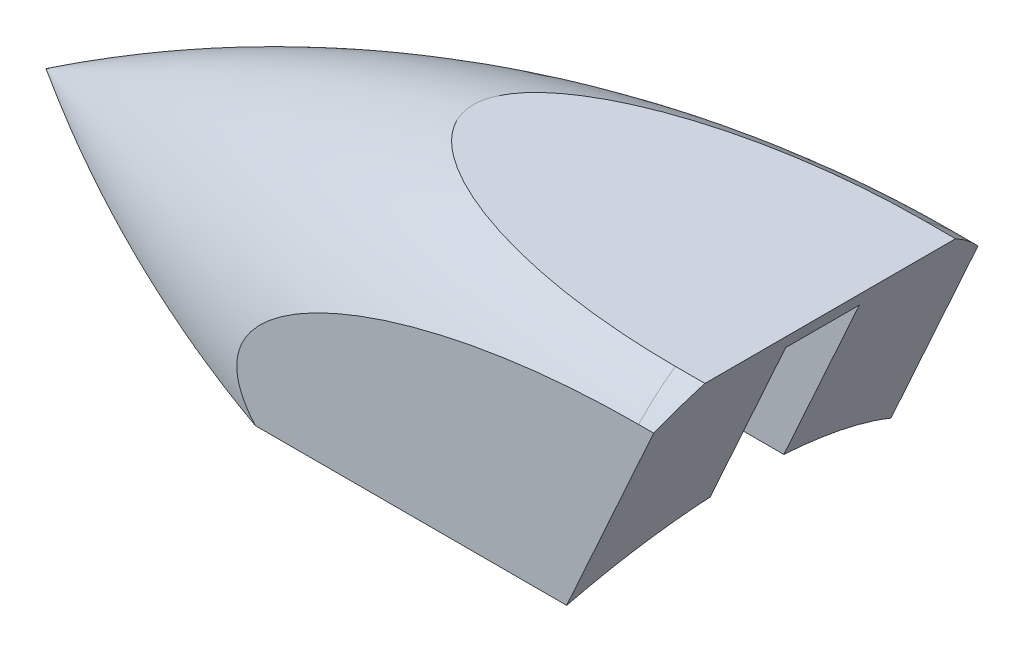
ISO-10303-21;
HEADER;
FILE_DESCRIPTION(('STEP AP214'),'2;1');
FILE_NAME('part.step','',(''),(''),'','','');
FILE_SCHEMA(('AUTOMOTIVE_DESIGN { 1 0 10303 214 1 1 1 1 }'));
ENDSEC;
DATA;
#1=APPLICATION_CONTEXT('core data for automotive mechanical design processes');
#2=APPLICATION_PROTOCOL_DEFINITION('international standard','automotive_design',2000,#1);
#3=PRODUCT_CONTEXT('',#1,'mechanical');
#4=PRODUCT('Part','Part','',(#3));
#5=PRODUCT_RELATED_PRODUCT_CATEGORY('part','',(#4));
#6=PRODUCT_DEFINITION_FORMATION('','',#4);
#7=PRODUCT_DEFINITION_CONTEXT('part definition',#1,'design');
#8=PRODUCT_DEFINITION('design','',#6,#7);
#9=PRODUCT_DEFINITION_SHAPE('','',#8);
#10=(LENGTH_UNIT() NAMED_UNIT(*) SI_UNIT(.MILLI.,.METRE.));
#11=(NAMED_UNIT(*) PLANE_ANGLE_UNIT() SI_UNIT($,.RADIAN.));
#12=(NAMED_UNIT(*) SI_UNIT($,.STERADIAN.) SOLID_ANGLE_UNIT());
#13=UNCERTAINTY_MEASURE_WITH_UNIT(LENGTH_MEASURE(1.E-05),#10,'distance_accuracy_value','');
#14=(GEOMETRIC_REPRESENTATION_CONTEXT(3) GLOBAL_UNCERTAINTY_ASSIGNED_CONTEXT((#13)) GLOBAL_UNIT_ASSIGNED_CONTEXT((#10,
#11,#12)) REPRESENTATION_CONTEXT('',''));
#15=CARTESIAN_POINT('',(0.,0.,0.));
#16=DIRECTION('',(0.,0.,1.));
#17=DIRECTION('',(1.,0.,0.));
#18=AXIS2_PLACEMENT_3D('',#15,#16,#17);
#19=CARTESIAN_POINT('',(2.54,0.,0.));
#20=DIRECTION('',(-1.,0.,0.));
#21=DIRECTION('',(0.,0.,1.));
#22=AXIS2_PLACEMENT_3D('',#19,#20,#21);
#23=CYLINDRICAL_SURFACE('',#22,19.05);
#24=DIRECTION('',(1.,0.,0.));
#25=VECTOR('',#24,1.);
#26=CARTESIAN_POINT('',(-65.0232843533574,12.9515095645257,13.97));
#27=LINE('',#26,#25);
#28=CARTESIAN_POINT('',(-3.05311331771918E-13,12.9515095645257,13.97));
#29=VERTEX_POINT('',#28);
#30=CARTESIAN_POINT('',(1.30003580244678,12.9515095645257,13.97));
#31=VERTEX_POINT('',#30);
#32=EDGE_CURVE('E174',#29,#31,#27,.T.);
#33=ORIENTED_EDGE('',*,*,#32,.T.);
#34=CARTESIAN_POINT('',(-4.551060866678,0.,0.));
#35=DIRECTION('',(-0.91131706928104,0.411705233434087,0.));
#36=DIRECTION('',(-0.411705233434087,-0.91131706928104,0.));
#37=AXIS2_PLACEMENT_3D('',#34,#35,#36);
#38=ELLIPSE('',#37,20.9038112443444,19.05);
#39=CARTESIAN_POINT('',(2.54,15.6961930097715,10.795));
#40=VERTEX_POINT('',#39);
#41=EDGE_CURVE('E154',#31,#40,#38,.T.);
#42=ORIENTED_EDGE('',*,*,#41,.T.);
#43=DIRECTION('',(1.,0.,0.));
#44=VECTOR('',#43,1.);
#45=CARTESIAN_POINT('',(-65.0232843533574,15.6961930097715,10.795));
#46=LINE('',#45,#44);
#47=CARTESIAN_POINT('',(0.,15.6961930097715,10.795));
#48=VERTEX_POINT('',#47);
#49=EDGE_CURVE('E334',#48,#40,#46,.T.);
#50=ORIENTED_EDGE('',*,*,#49,.F.);
#51=CARTESIAN_POINT('',(0.,0.,0.));
#52=DIRECTION('',(1.,0.,0.));
#53=DIRECTION('',(0.,1.,0.));
#54=AXIS2_PLACEMENT_3D('',#51,#52,#53);
#55=CIRCLE('',#54,19.05);
#56=EDGE_CURVE('E177',#48,#29,#55,.T.);
#57=ORIENTED_EDGE('',*,*,#56,.T.);
#58=EDGE_LOOP('',(#33,#42,#50,#57));
#59=FACE_BOUND('',#58,.T.);
#60=ADVANCED_FACE('F43',(#59),#23,.T.);
#61=DIRECTION('',(1.,0.,0.));
#62=VECTOR('',#61,1.);
#63=CARTESIAN_POINT('',(-65.0232843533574,15.6961930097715,-10.795));
#64=LINE('',#63,#62);
#65=CARTESIAN_POINT('',(0.,15.6961930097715,-10.795));
#66=VERTEX_POINT('',#65);
#67=CARTESIAN_POINT('',(2.54,15.6961930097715,-10.795));
#68=VERTEX_POINT('',#67);
#69=EDGE_CURVE('E186',#66,#68,#64,.T.);
#70=ORIENTED_EDGE('',*,*,#69,.T.);
#71=CARTESIAN_POINT('',(-4.551060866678,0.,0.));
#72=DIRECTION('',(-0.91131706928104,0.411705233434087,0.));
#73=DIRECTION('',(-0.411705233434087,-0.91131706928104,0.));
#74=AXIS2_PLACEMENT_3D('',#71,#72,#73);
#75=ELLIPSE('',#74,20.9038112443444,19.05);
#76=CARTESIAN_POINT('',(1.30003580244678,12.9515095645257,-13.97));
#77=VERTEX_POINT('',#76);
#78=EDGE_CURVE('E168',#68,#77,#75,.T.);
#79=ORIENTED_EDGE('',*,*,#78,.T.);
#80=DIRECTION('',(1.,0.,0.));
#81=VECTOR('',#80,1.);
#82=CARTESIAN_POINT('',(-65.0232843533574,12.9515095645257,-13.97));
#83=LINE('',#82,#81);
#84=CARTESIAN_POINT('',(-3.19189119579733E-13,12.9515095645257,-13.97));
#85=VERTEX_POINT('',#84);
#86=EDGE_CURVE('E180',#85,#77,#83,.T.);
#87=ORIENTED_EDGE('',*,*,#86,.F.);
#88=EDGE_CURVE('E187',#85,#66,#55,.T.);
#89=ORIENTED_EDGE('',*,*,#88,.T.);
#90=EDGE_LOOP('',(#70,#79,#87,#89));
#91=FACE_BOUND('',#90,.T.);
#92=ADVANCED_FACE('F45',(#91),#23,.T.);
#93=CARTESIAN_POINT('',(0.,-101.446850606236,0.));
#94=DIRECTION('',(0.,0.,-1.));
#95=DIRECTION('',(0.,1.,0.));
#96=AXIS2_PLACEMENT_3D('',#93,#94,#95);
#97=CIRCLE('',#96,120.496850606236);
#98=TRIMMED_CURVE('',#97,(PARAMETER_VALUE(-0.569993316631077)),
(PARAMETER_VALUE(0.569993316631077)),.T.,.PARAMETER.);
#99=CARTESIAN_POINT('',(0.,0.,0.));
#100=DIRECTION('',(1.,0.,0.));
#101=AXIS1_PLACEMENT('',#99,#100);
#102=SURFACE_OF_REVOLUTION('',#98,#101);
#103=CARTESIAN_POINT('',(-28.2311589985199,15.6961930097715,0.));
#104=CARTESIAN_POINT('',(-28.2311637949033,15.6961930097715,0.124324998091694));
#105=CARTESIAN_POINT('',(-28.2250086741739,15.6961930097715,0.248625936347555));
#106=CARTESIAN_POINT('',(-28.2006515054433,15.6961930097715,0.496058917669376));
#107=CARTESIAN_POINT('',(-28.1824456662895,15.6961930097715,0.61919058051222));
#108=CARTESIAN_POINT('',(-28.1105048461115,15.6961930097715,0.985505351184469));
#109=CARTESIAN_POINT('',(-28.0394479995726,15.6961930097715,1.22540887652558));
#110=CARTESIAN_POINT('',(-27.8376268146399,15.6961930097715,1.74608543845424));
#111=CARTESIAN_POINT('',(-27.6965925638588,15.6961930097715,2.02275224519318));
#112=CARTESIAN_POINT('',(-27.3727061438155,15.6961930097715,2.55029773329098));
#113=CARTESIAN_POINT('',(-27.1897665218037,15.6961930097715,2.80112087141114));
#114=CARTESIAN_POINT('',(-26.8199944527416,15.6961930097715,3.24812680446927));
#115=CARTESIAN_POINT('',(-26.636585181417,15.6961930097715,3.44720728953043));
#116=CARTESIAN_POINT('',(-26.2533366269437,15.6961930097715,3.82902661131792));
#117=CARTESIAN_POINT('',(-26.0534841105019,15.6961930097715,4.0117520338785));
#118=CARTESIAN_POINT('',(-25.6410958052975,15.6961930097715,4.36312577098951));
#119=CARTESIAN_POINT('',(-25.4285322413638,15.6961930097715,4.53174117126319));
#120=CARTESIAN_POINT('',(-24.994040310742,15.6961930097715,4.85620341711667));
#121=CARTESIAN_POINT('',(-24.7721146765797,15.6961930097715,5.01205394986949));
#122=CARTESIAN_POINT('',(-24.2344643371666,15.6961930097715,5.37013753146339));
#123=CARTESIAN_POINT('',(-23.9153585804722,15.6961930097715,5.56728316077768));
#124=CARTESIAN_POINT('',(-23.2665960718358,15.6961930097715,5.94350629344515));
#125=CARTESIAN_POINT('',(-22.9369348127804,15.6961930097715,6.12257593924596));
#126=CARTESIAN_POINT('',(-22.2690974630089,15.6961930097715,6.46526380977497));
#127=CARTESIAN_POINT('',(-21.9309094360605,15.6961930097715,6.62885865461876));
#128=CARTESIAN_POINT('',(-21.2481703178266,15.6961930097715,6.94220137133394));
#129=CARTESIAN_POINT('',(-20.9036185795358,15.6961930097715,7.09194782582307));
#130=CARTESIAN_POINT('',(-20.2078953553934,15.6961930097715,7.37968050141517));
#131=CARTESIAN_POINT('',(-19.8567015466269,15.6961930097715,7.51761256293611));
#132=CARTESIAN_POINT('',(-19.1500885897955,15.6961930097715,7.78215133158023));
#133=CARTESIAN_POINT('',(-18.7946693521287,15.6961930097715,7.90875779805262));
#134=CARTESIAN_POINT('',(-17.7237564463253,15.6961930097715,8.27284637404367));
#135=CARTESIAN_POINT('',(-17.0029718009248,15.6961930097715,8.49485571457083));
#136=CARTESIAN_POINT('',(-15.5229978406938,15.6961930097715,8.91107725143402));
#137=CARTESIAN_POINT('',(-14.7634113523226,15.6961930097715,9.10385689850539));
#138=CARTESIAN_POINT('',(-13.2361923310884,15.6961930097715,9.45489754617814));
#139=CARTESIAN_POINT('',(-12.468558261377,15.6961930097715,9.61315182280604));
#140=CARTESIAN_POINT('',(-10.9266868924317,15.6961930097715,9.8980597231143));
#141=CARTESIAN_POINT('',(-10.1524437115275,15.6961930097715,10.0246812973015));
#142=CARTESIAN_POINT('',(-8.59973657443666,15.6961930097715,10.2480649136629));
#143=CARTESIAN_POINT('',(-7.82127290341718,15.6961930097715,10.3448289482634));
#144=CARTESIAN_POINT('',(-6.2625763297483,15.6961930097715,10.5097135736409));
#145=CARTESIAN_POINT('',(-5.48234816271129,15.6961930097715,10.57787915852));
#146=CARTESIAN_POINT('',(-3.91996570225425,15.6961930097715,10.6866512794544));
#147=CARTESIAN_POINT('',(-3.13781137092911,15.6961930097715,10.7272572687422));
#148=CARTESIAN_POINT('',(-1.57305190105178,15.6961930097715,10.7813780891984));
#149=CARTESIAN_POINT('',(-0.790447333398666,15.6961930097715,10.7949095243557));
#150=CARTESIAN_POINT('',(0.774750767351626,15.6961930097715,10.7950895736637));
#151=CARTESIAN_POINT('',(1.55734430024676,15.6961930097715,10.7817388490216));
#152=CARTESIAN_POINT('',(3.01564101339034,15.6961930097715,10.7316372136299));
#153=CARTESIAN_POINT('',(3.69146340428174,15.6961930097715,10.6983010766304));
#154=CARTESIAN_POINT('',(5.04178492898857,15.6961930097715,10.6111174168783));
#155=CARTESIAN_POINT('',(5.71628407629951,15.6961930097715,10.5572701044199));
#156=CARTESIAN_POINT('',(7.06363618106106,15.6961930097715,10.4285288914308));
#157=CARTESIAN_POINT('',(7.73648808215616,15.6961930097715,10.3536239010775));
#158=CARTESIAN_POINT('',(9.07941261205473,15.6961930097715,10.1820337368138));
#159=CARTESIAN_POINT('',(9.74948526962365,15.6961930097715,10.0853487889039));
#160=CARTESIAN_POINT('',(11.0879619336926,15.6961930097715,9.86882360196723));
#161=CARTESIAN_POINT('',(11.7563548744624,15.6961930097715,9.74891465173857));
#162=CARTESIAN_POINT('',(13.0882867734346,15.6961930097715,9.4846726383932));
#163=CARTESIAN_POINT('',(13.75182594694,15.6961930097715,9.34034066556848));
#164=CARTESIAN_POINT('',(15.0719758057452,15.6961930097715,9.02539187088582));
#165=CARTESIAN_POINT('',(15.7285927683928,15.6961930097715,8.85480153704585));
#166=CARTESIAN_POINT('',(17.0334539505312,15.6961930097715,8.48446977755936));
#167=CARTESIAN_POINT('',(17.6816997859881,15.6961930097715,8.28473407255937));
#168=CARTESIAN_POINT('',(18.9710084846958,15.6961930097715,7.85083929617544));
#169=CARTESIAN_POINT('',(19.6120062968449,15.6961930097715,7.61648385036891));
#170=CARTESIAN_POINT('',(20.5619850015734,15.6961930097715,7.23518457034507));
#171=CARTESIAN_POINT('',(20.8769289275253,15.6961930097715,7.10302673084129));
#172=CARTESIAN_POINT('',(21.5020030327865,15.6961930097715,6.8277503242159));
#173=CARTESIAN_POINT('',(21.8121333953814,15.6961930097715,6.6846321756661));
#174=CARTESIAN_POINT('',(22.423933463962,15.6961930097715,6.38740634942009));
#175=CARTESIAN_POINT('',(22.725651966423,15.6961930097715,6.23339949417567));
#176=CARTESIAN_POINT('',(23.3218636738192,15.6961930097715,5.91175191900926));
#177=CARTESIAN_POINT('',(23.6163552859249,15.6961930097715,5.74410822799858));
#178=CARTESIAN_POINT('',(24.1952780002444,15.6961930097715,5.39363296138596));
#179=CARTESIAN_POINT('',(24.4797308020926,15.6961930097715,5.21083742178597));
#180=CARTESIAN_POINT('',(25.0361658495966,15.6961930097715,4.82728687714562));
#181=CARTESIAN_POINT('',(25.3081560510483,15.6961930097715,4.62654357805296));
#182=CARTESIAN_POINT('',(25.7242085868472,15.6961930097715,4.29285483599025));
#183=CARTESIAN_POINT('',(25.873921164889,15.6961930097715,4.16694601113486));
#184=CARTESIAN_POINT('',(26.1664295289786,15.6961930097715,3.90724832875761));
#185=CARTESIAN_POINT('',(26.3092243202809,15.6961930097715,3.77345834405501));
#186=CARTESIAN_POINT('',(26.5861672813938,15.6961930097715,3.49732405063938));
#187=CARTESIAN_POINT('',(26.7203210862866,15.6961930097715,3.35498543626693));
#188=CARTESIAN_POINT('',(26.9778967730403,15.6961930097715,3.06096774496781));
#189=CARTESIAN_POINT('',(27.1013223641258,15.6961930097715,2.90929192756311));
#190=CARTESIAN_POINT('',(27.3835789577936,15.6961930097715,2.53040264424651));
#191=CARTESIAN_POINT('',(27.5357082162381,15.6961930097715,2.29806733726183));
#192=CARTESIAN_POINT('',(27.8026747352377,15.6961930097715,1.8127920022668));
#193=CARTESIAN_POINT('',(27.9175769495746,15.6961930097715,1.55988883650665));
#194=CARTESIAN_POINT('',(28.0801059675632,15.6961930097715,1.08868618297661));
#195=CARTESIAN_POINT('',(28.1365569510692,15.6961930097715,0.873474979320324));
#196=CARTESIAN_POINT('',(28.2122541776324,15.6961930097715,0.436635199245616));
#197=CARTESIAN_POINT('',(28.2315387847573,15.6961930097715,0.2150134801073));
#198=CARTESIAN_POINT('',(28.2307672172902,15.6961930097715,-0.228489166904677));
#199=CARTESIAN_POINT('',(28.2106529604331,15.6961930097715,-0.450369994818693));
#200=CARTESIAN_POINT('',(28.1332810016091,15.6961930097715,-0.88757248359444));
#201=CARTESIAN_POINT('',(28.0759857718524,15.6961930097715,-1.10288728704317));
#202=CARTESIAN_POINT('',(27.9068371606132,15.6961930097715,-1.58787938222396));
#203=CARTESIAN_POINT('',(27.7835281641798,15.6961930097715,-1.85351199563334));
#204=CARTESIAN_POINT('',(27.4965460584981,15.6961930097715,-2.36193111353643));
#205=CARTESIAN_POINT('',(27.3327815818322,15.6961930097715,-2.6046641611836));
#206=CARTESIAN_POINT('',(27.0025851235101,15.6961930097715,-3.03416924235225));
#207=CARTESIAN_POINT('',(26.8399827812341,15.6961930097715,-3.22395224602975));
#208=CARTESIAN_POINT('',(26.4989782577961,15.6961930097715,-3.58888243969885));
#209=CARTESIAN_POINT('',(26.3205639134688,15.6961930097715,-3.76401815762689));
#210=CARTESIAN_POINT('',(25.9513838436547,15.6961930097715,-4.10154076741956));
#211=CARTESIAN_POINT('',(25.7605896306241,15.6961930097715,-4.26389620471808));
#212=CARTESIAN_POINT('',(25.3697752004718,15.6961930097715,-4.57689500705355));
#213=CARTESIAN_POINT('',(25.1697574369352,15.6961930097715,-4.72754145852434));
#214=CARTESIAN_POINT('',(24.6919094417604,15.6961930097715,-5.06887673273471));
#215=CARTESIAN_POINT('',(24.4111007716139,15.6961930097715,-5.25538611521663));
#216=CARTESIAN_POINT('',(23.8394575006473,15.6961930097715,-5.61246103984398));
#217=CARTESIAN_POINT('',(23.5486187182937,15.6961930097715,-5.78301981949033));
#218=CARTESIAN_POINT('',(22.958826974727,15.6961930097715,-6.11044120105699));
#219=CARTESIAN_POINT('',(22.6598630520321,15.6961930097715,-6.26728396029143));
#220=CARTESIAN_POINT('',(22.0557690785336,15.6961930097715,-6.56867481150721));
#221=CARTESIAN_POINT('',(21.750637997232,15.6961930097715,-6.71322082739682));
#222=CARTESIAN_POINT('',(21.1342776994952,15.6961930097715,-6.99181533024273));
#223=CARTESIAN_POINT('',(20.8230301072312,15.6961930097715,-7.12582302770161));
#224=CARTESIAN_POINT('',(20.1963924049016,15.6961930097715,-7.38380401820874));
#225=CARTESIAN_POINT('',(19.8810019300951,15.6961930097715,-7.50777642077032));
#226=CARTESIAN_POINT('',(18.9302268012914,15.6961930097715,-7.865746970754));
#227=CARTESIAN_POINT('',(18.2896621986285,15.6961930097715,-8.08605423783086));
#228=CARTESIAN_POINT('',(16.9561366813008,15.6961930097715,-8.50867985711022));
#229=CARTESIAN_POINT('',(16.2625052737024,15.6961930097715,-8.70885514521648));
#230=CARTESIAN_POINT('',(14.8668027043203,15.6961930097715,-9.07765776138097));
#231=CARTESIAN_POINT('',(14.1647298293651,15.6961930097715,-9.24627856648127));
#232=CARTESIAN_POINT('',(12.7536690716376,15.6961930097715,-9.55496795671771));
#233=CARTESIAN_POINT('',(12.044675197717,15.6961930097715,-9.69500897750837));
#234=CARTESIAN_POINT('',(10.621924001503,15.6961930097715,-9.94840060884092));
#235=CARTESIAN_POINT('',(9.90816646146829,15.6961930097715,-10.0617499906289));
#236=CARTESIAN_POINT('',(8.47584178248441,15.6961930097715,-10.2633939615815));
#237=CARTESIAN_POINT('',(7.75726834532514,15.6961930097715,-10.3516436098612));
#238=CARTESIAN_POINT('',(6.31755522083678,15.6961930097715,-10.5038534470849));
#239=CARTESIAN_POINT('',(5.59641550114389,15.6961930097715,-10.5678133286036));
#240=CARTESIAN_POINT('',(4.15284939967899,15.6961930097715,-10.6721063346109));
#241=CARTESIAN_POINT('',(3.43042398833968,15.6961930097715,-10.7124529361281));
#242=CARTESIAN_POINT('',(1.98465354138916,15.6961930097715,-10.7699904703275));
#243=CARTESIAN_POINT('',(1.26130849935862,15.6961930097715,-10.787181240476));
#244=CARTESIAN_POINT('',(-0.276622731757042,15.6961930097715,-10.7992989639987));
#245=CARTESIAN_POINT('',(-1.09123484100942,15.6961930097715,-10.7911516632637));
#246=CARTESIAN_POINT('',(-2.71966398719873,15.6961930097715,-10.7456274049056));
#247=CARTESIAN_POINT('',(-3.53348100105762,15.6961930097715,-10.7082496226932));
#248=CARTESIAN_POINT('',(-5.1599304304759,15.6961930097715,-10.6037349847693));
#249=CARTESIAN_POINT('',(-5.9725611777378,15.6961930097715,-10.5365720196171));
#250=CARTESIAN_POINT('',(-7.59468669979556,15.6961930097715,-10.3715705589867));
#251=CARTESIAN_POINT('',(-8.40418159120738,15.6961930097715,-10.2737332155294));
#252=CARTESIAN_POINT('',(-10.0135088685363,15.6961930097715,-10.0466645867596));
#253=CARTESIAN_POINT('',(-10.813369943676,15.6961930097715,-9.91763794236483));
#254=CARTESIAN_POINT('',(-12.4070333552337,15.6961930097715,-9.62573924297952));
#255=CARTESIAN_POINT('',(-13.2008348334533,15.6961930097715,-9.46286248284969));
#256=CARTESIAN_POINT('',(-14.7789075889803,15.6961930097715,-9.10045516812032));
#257=CARTESIAN_POINT('',(-15.5631912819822,15.6961930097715,-8.90097947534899));
#258=CARTESIAN_POINT('',(-16.7306635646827,15.6961930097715,-8.57075785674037));
#259=CARTESIAN_POINT('',(-17.1182777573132,15.6961930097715,-8.45553337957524));
#260=CARTESIAN_POINT('',(-17.8900058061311,15.6961930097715,-8.21393543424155));
#261=CARTESIAN_POINT('',(-18.2741199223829,15.6961930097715,-8.08756280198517));
#262=CARTESIAN_POINT('',(-18.9779898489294,15.6961930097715,-7.84355610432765));
#263=CARTESIAN_POINT('',(-19.2983550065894,15.6961930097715,-7.72767980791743));
#264=CARTESIAN_POINT('',(-19.9355620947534,15.6961930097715,-7.48660403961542));
#265=CARTESIAN_POINT('',(-20.2524040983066,15.6961930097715,-7.3614047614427));
#266=CARTESIAN_POINT('',(-20.8826707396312,15.6961930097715,-7.10047451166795));
#267=CARTESIAN_POINT('',(-21.196084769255,15.6961930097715,-6.96471782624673));
#268=CARTESIAN_POINT('',(-21.817753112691,15.6961930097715,-6.68185369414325));
#269=CARTESIAN_POINT('',(-22.1260075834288,15.6961930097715,-6.53474659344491));
#270=CARTESIAN_POINT('',(-22.7759551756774,15.6961930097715,-6.20777949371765));
#271=CARTESIAN_POINT('',(-23.1167648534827,15.6961930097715,-6.02615021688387));
#272=CARTESIAN_POINT('',(-23.7879117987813,15.6961930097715,-5.64397697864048));
#273=CARTESIAN_POINT('',(-24.1182440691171,15.6961930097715,-5.44342416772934));
#274=CARTESIAN_POINT('',(-24.7633491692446,15.6961930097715,-5.0208380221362));
#275=CARTESIAN_POINT('',(-25.0781725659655,15.6961930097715,-4.79888259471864));
#276=CARTESIAN_POINT('',(-25.6873466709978,15.6961930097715,-4.32872380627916));
#277=CARTESIAN_POINT('',(-25.9817224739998,15.6961930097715,-4.08055359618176));
#278=CARTESIAN_POINT('',(-26.4866288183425,15.6961930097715,-3.60330609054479));
#279=CARTESIAN_POINT('',(-26.7023718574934,15.6961930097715,-3.3797993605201));
#280=CARTESIAN_POINT('',(-27.1063510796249,15.6961930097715,-2.90866306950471));
#281=CARTESIAN_POINT('',(-27.2945918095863,15.6961930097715,-2.66103750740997));
#282=CARTESIAN_POINT('',(-27.6072468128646,15.6961930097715,-2.17690057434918));
#283=CARTESIAN_POINT('',(-27.7369367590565,15.6961930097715,-1.94385062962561));
#284=CARTESIAN_POINT('',(-27.9564718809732,15.6961930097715,-1.45974043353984));
#285=CARTESIAN_POINT('',(-28.0464248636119,15.6961930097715,-1.20873108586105));
#286=CARTESIAN_POINT('',(-28.1505400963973,15.6961930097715,-0.796108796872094));
#287=CARTESIAN_POINT('',(-28.180608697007,15.6961930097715,-0.638440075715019));
#288=CARTESIAN_POINT('',(-28.2209149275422,15.6961930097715,-0.320500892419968));
#289=CARTESIAN_POINT('',(-28.2311528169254,15.6961930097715,-0.160230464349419));
#290=CARTESIAN_POINT('',(-28.2311589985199,15.6961930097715,0.));
#291=B_SPLINE_CURVE_WITH_KNOTS('',3,(#103,#104,#105,#106,#107,#108,#109,#110,#111,#112,#113,
#114,#115,#116,#117,#118,#119,#120,#121,#122,#123,#124,#125,#126,#127,#128,#129,#130,#131,#132,
#133,#134,#135,#136,#137,#138,#139,#140,#141,#142,#143,#144,#145,#146,#147,#148,#149,#150,#151,
#152,#153,#154,#155,#156,#157,#158,#159,#160,#161,#162,#163,#164,#165,#166,#167,#168,#169,#170,
#171,#172,#173,#174,#175,#176,#177,#178,#179,#180,#181,#182,#183,#184,#185,#186,#187,#188,#189,
#190,#191,#192,#193,#194,#195,#196,#197,#198,#199,#200,#201,#202,#203,#204,#205,#206,#207,#208,
#209,#210,#211,#212,#213,#214,#215,#216,#217,#218,#219,#220,#221,#222,#223,#224,#225,#226,#227,
#228,#229,#230,#231,#232,#233,#234,#235,#236,#237,#238,#239,#240,#241,#242,#243,#244,#245,#246,
#247,#248,#249,#250,#251,#252,#253,#254,#255,#256,#257,#258,#259,#260,#261,#262,#263,#264,#265,
#266,#267,#268,#269,#270,#271,#272,#273,#274,#275,#276,#277,#278,#279,#280,#281,#282,#283,#284,
#285,#286,#287,#288,#289,#290),.UNSPECIFIED.,.T.,.F.,(4,2,2,2,2,2,2,2,2,2,2,2,2,2,2,2,2,2,2,2,2,
2,2,2,2,2,2,2,2,2,2,2,2,2,2,2,2,2,2,2,2,2,2,2,2,2,2,2,2,2,2,2,2,2,2,2,2,2,2,2,2,2,2,2,2,2,2,2,2,
2,2,2,2,2,2,2,2,2,2,2,2,2,2,2,2,2,2,2,2,2,2,2,2,4),(0.,0.372773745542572,0.745664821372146,
1.4920350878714,2.41849946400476,3.34691519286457,4.15782551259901,4.96939494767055,
5.78280760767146,6.59598447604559,7.72050071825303,8.84550369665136,9.97218009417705,
11.0989716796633,12.2306793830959,13.3624111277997,15.6238194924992,17.9739627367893,
20.3245632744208,22.6775358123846,25.0303512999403,27.3794510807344,29.7285974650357,
32.076302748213,34.4239502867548,36.4535849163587,38.4831987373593,40.5138834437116,
42.5445470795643,44.581313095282,46.6179882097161,48.6526221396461,50.6868572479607,
52.7331088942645,53.7575877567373,54.7820275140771,55.7979835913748,56.8141616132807,
57.8279886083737,58.8411591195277,59.4277891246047,60.0145032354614,60.6008307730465,
61.1869547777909,62.0175224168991,62.8466329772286,63.5112639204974,64.1752084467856,
64.8401325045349,65.5057287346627,66.3793745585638,67.255011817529,68.0036868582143,
68.7529428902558,69.5039887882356,70.2548360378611,71.2654683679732,72.2765272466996,
73.2890254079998,74.3016941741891,75.3181071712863,76.3346102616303,78.3657281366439,
80.5307330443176,82.6961850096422,84.8637157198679,87.0313461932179,89.2028337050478,
91.3743486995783,93.5446231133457,95.7149127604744,98.1583400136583,100.601836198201,
103.04747857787,105.493029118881,107.922949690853,110.353208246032,112.779853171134,
113.99285258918,115.205761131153,116.22766538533,117.24954841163,118.27400338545,
119.29842714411,120.456484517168,121.615086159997,122.769619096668,123.922709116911,
124.853081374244,125.783299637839,126.580698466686,127.375920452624,127.856358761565,
128.336790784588),.UNSPECIFIED.);
#292=EDGE_CURVE('E268',#66,#48,#291,.T.);
#293=ORIENTED_EDGE('',*,*,#292,.F.);
#294=ORIENTED_EDGE('',*,*,#88,.F.);
#295=CARTESIAN_POINT('',(-32.2834160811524,4.39424132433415,-13.97));
#296=CARTESIAN_POINT('',(-32.5264805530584,4.16898384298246,-13.97));
#297=CARTESIAN_POINT('',(-32.760458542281,3.93372806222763,-13.97));
#298=CARTESIAN_POINT('',(-33.2033269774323,3.43986015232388,-13.97));
#299=CARTESIAN_POINT('',(-33.4121839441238,3.18121764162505,-13.97));
#300=CARTESIAN_POINT('',(-33.7961388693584,2.63426594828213,-13.97));
#301=CARTESIAN_POINT('',(-33.9707911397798,2.34563168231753,-13.97));
#302=CARTESIAN_POINT('',(-34.1925395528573,1.89339363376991,-13.97));
#303=CARTESIAN_POINT('',(-34.2597073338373,1.73958352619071,-13.97));
#304=CARTESIAN_POINT('',(-34.378489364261,1.42611405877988,-13.97));
#305=CARTESIAN_POINT('',(-34.4301113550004,1.26645765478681,-13.97));
#306=CARTESIAN_POINT('',(-34.5345819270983,0.87047653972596,-13.97));
#307=CARTESIAN_POINT('',(-34.5778530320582,0.631505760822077,-13.97));
#308=CARTESIAN_POINT('',(-34.622755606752,0.149779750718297,-13.97));
#309=CARTESIAN_POINT('',(-34.6244142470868,-0.092972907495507,-13.97));
#310=CARTESIAN_POINT('',(-34.5860119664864,-0.574771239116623,-13.97));
#311=CARTESIAN_POINT('',(-34.5460032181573,-0.813821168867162,-13.97));
#312=CARTESIAN_POINT('',(-34.4286493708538,-1.28254798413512,-13.97));
#313=CARTESIAN_POINT('',(-34.3512649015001,-1.51221470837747,-13.97));
#314=CARTESIAN_POINT('',(-34.1223999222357,-2.06278286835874,-13.97));
#315=CARTESIAN_POINT('',(-33.9531938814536,-2.37624443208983,-13.97));
#316=CARTESIAN_POINT('',(-33.5686292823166,-2.97339409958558,-13.97));
#317=CARTESIAN_POINT('',(-33.3531423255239,-3.25699603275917,-13.97));
#318=CARTESIAN_POINT('',(-32.9085922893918,-3.77615124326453,-13.97));
#319=CARTESIAN_POINT('',(-32.6818385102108,-4.01372148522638,-13.97));
#320=CARTESIAN_POINT('',(-32.2089217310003,-4.46887953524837,-13.97));
#321=CARTESIAN_POINT('',(-31.9627411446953,-4.6864488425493,-13.97));
#322=CARTESIAN_POINT('',(-31.4556038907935,-5.10473938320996,-13.97));
#323=CARTESIAN_POINT('',(-31.1946133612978,-5.30541916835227,-13.97));
#324=CARTESIAN_POINT('',(-30.6619100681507,-5.69167442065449,-13.97));
#325=CARTESIAN_POINT('',(-30.3902010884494,-5.87725514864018,-13.97));
#326=CARTESIAN_POINT('',(-29.7094185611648,-6.31904669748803,-13.97));
#327=CARTESIAN_POINT('',(-29.2954786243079,-6.56774561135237,-13.97));
#328=CARTESIAN_POINT('',(-28.4543571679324,-7.04181735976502,-13.97));
#329=CARTESIAN_POINT('',(-28.027169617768,-7.26717936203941,-13.97));
#330=CARTESIAN_POINT('',(-27.1621170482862,-7.69821144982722,-13.97));
#331=CARTESIAN_POINT('',(-26.724235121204,-7.90384742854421,-13.97));
#332=CARTESIAN_POINT('',(-25.8407404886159,-8.29748017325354,-13.97));
#333=CARTESIAN_POINT('',(-25.3951290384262,-8.48547977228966,-13.97));
#334=CARTESIAN_POINT('',(-24.4956876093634,-8.84655753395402,-13.97));
#335=CARTESIAN_POINT('',(-24.0418304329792,-9.01956769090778,-13.97));
#336=CARTESIAN_POINT('',(-23.128906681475,-9.35123312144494,-13.97));
#337=CARTESIAN_POINT('',(-22.669839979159,-9.50988804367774,-13.97));
#338=CARTESIAN_POINT('',(-21.7477758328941,-9.81385766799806,-13.97));
#339=CARTESIAN_POINT('',(-21.2847822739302,-9.95918418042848,-13.97));
#340=CARTESIAN_POINT('',(-20.3551107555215,-10.2375632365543,-13.97));
#341=CARTESIAN_POINT('',(-19.888432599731,-10.3706151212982,-13.97));
#342=CARTESIAN_POINT('',(-18.4664555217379,-10.7571736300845,-13.97));
#343=CARTESIAN_POINT('',(-17.5061848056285,-10.9925519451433,-13.97));
#344=CARTESIAN_POINT('',(-15.5760011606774,-11.4200347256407,-13.97));
#345=CARTESIAN_POINT('',(-14.6060865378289,-11.6121314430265,-13.97));
#346=CARTESIAN_POINT('',(-12.65819284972,-11.9561311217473,-13.97));
#347=CARTESIAN_POINT('',(-11.6802067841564,-12.1079943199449,-13.97));
#348=CARTESIAN_POINT('',(-9.71912412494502,-12.3732745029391,-13.97));
#349=CARTESIAN_POINT('',(-8.73602785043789,-12.4866938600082,-13.97));
#350=CARTESIAN_POINT('',(-6.76804957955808,-12.6762515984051,-13.97));
#351=CARTESIAN_POINT('',(-5.78317399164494,-12.7524567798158,-13.97));
#352=CARTESIAN_POINT('',(-3.81127687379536,-12.868704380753,-13.97));
#353=CARTESIAN_POINT('',(-2.82425529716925,-12.9087460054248,-13.97));
#354=CARTESIAN_POINT('',(-0.850017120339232,-12.9530545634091,-13.97));
#355=CARTESIAN_POINT('',(0.137198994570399,-12.9573432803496,-13.97));
#356=CARTESIAN_POINT('',(2.11111849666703,-12.9302470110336,-13.97));
#357=CARTESIAN_POINT('',(3.09782190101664,-12.8988633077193,-13.97));
#358=CARTESIAN_POINT('',(4.87170853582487,-12.8100082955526,-13.97));
#359=CARTESIAN_POINT('',(5.65922293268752,-12.759030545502,-13.97));
#360=CARTESIAN_POINT('',(7.23238789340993,-12.633728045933,-13.97));
#361=CARTESIAN_POINT('',(8.01803849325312,-12.5594037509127,-13.97));
#362=CARTESIAN_POINT('',(9.58704609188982,-12.3868490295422,-13.97));
#363=CARTESIAN_POINT('',(10.3704020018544,-12.2886086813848,-13.97));
#364=CARTESIAN_POINT('',(11.9336341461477,-12.0674868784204,-13.97));
#365=CARTESIAN_POINT('',(12.7135104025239,-11.9446055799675,-13.97));
#366=CARTESIAN_POINT('',(14.2702295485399,-11.6729106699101,-13.97));
#367=CARTESIAN_POINT('',(15.04706419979,-11.5240496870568,-13.97));
#368=CARTESIAN_POINT('',(16.5950853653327,-11.199105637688,-13.97));
#369=CARTESIAN_POINT('',(17.3662715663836,-11.0230210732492,-13.97));
#370=CARTESIAN_POINT('',(18.9007613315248,-10.6418231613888,-13.97));
#371=CARTESIAN_POINT('',(19.6640711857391,-10.4367352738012,-13.97));
#372=CARTESIAN_POINT('',(21.1813067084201,-9.99469338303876,-13.97));
#373=CARTESIAN_POINT('',(21.9352339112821,-9.75774466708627,-13.97));
#374=CARTESIAN_POINT('',(23.4334328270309,-9.24720544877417,-13.97));
#375=CARTESIAN_POINT('',(24.1776659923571,-8.9735002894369,-13.97));
#376=CARTESIAN_POINT('',(25.2817332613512,-8.53134103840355,-13.97));
#377=CARTESIAN_POINT('',(25.6478914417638,-8.37860208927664,-13.97));
#378=CARTESIAN_POINT('',(26.3751767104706,-8.06155213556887,-13.97));
#379=CARTESIAN_POINT('',(26.7363039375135,-7.89724145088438,-13.97));
#380=CARTESIAN_POINT('',(27.4504425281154,-7.55673978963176,-13.97));
#381=CARTESIAN_POINT('',(27.8034881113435,-7.38062081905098,-13.97));
#382=CARTESIAN_POINT('',(28.5021753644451,-7.01405097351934,-13.97));
#383=CARTESIAN_POINT('',(28.847815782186,-6.82359769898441,-13.97));
#384=CARTESIAN_POINT('',(29.5290016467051,-6.42668549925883,-13.97));
#385=CARTESIAN_POINT('',(29.8645640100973,-6.22025574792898,-13.97));
#386=CARTESIAN_POINT('',(30.5232318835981,-5.78851925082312,-13.97));
#387=CARTESIAN_POINT('',(30.8463434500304,-5.56322185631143,-13.97));
#388=CARTESIAN_POINT('',(31.3626948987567,-5.17520981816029,-13.97));
#389=CARTESIAN_POINT('',(31.5608890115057,-5.0190905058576,-13.97));
#390=CARTESIAN_POINT('',(31.9487624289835,-4.69647181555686,-13.97));
#391=CARTESIAN_POINT('',(32.1384400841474,-4.52997044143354,-13.97));
#392=CARTESIAN_POINT('',(32.5067263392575,-4.18559039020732,-13.97));
#393=CARTESIAN_POINT('',(32.6853510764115,-4.00772910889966,-13.97));
#394=CARTESIAN_POINT('',(33.0286671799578,-3.63912354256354,-13.97));
#395=CARTESIAN_POINT('',(33.1933657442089,-3.44838600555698,-13.97));
#396=CARTESIAN_POINT('',(33.5419797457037,-3.00535726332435,-13.97));
#397=CARTESIAN_POINT('',(33.7211218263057,-2.74922921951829,-13.97));
#398=CARTESIAN_POINT('',(34.0406954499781,-2.2136850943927,-13.97));
#399=CARTESIAN_POINT('',(34.1811836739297,-1.93430390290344,-13.97));
#400=CARTESIAN_POINT('',(34.3871955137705,-1.41103427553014,-13.97));
#401=CARTESIAN_POINT('',(34.46199828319,-1.17085960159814,-13.97));
#402=CARTESIAN_POINT('',(34.5702318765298,-0.681397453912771,-13.97));
#403=CARTESIAN_POINT('',(34.6037152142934,-0.432121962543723,-13.97));
#404=CARTESIAN_POINT('',(34.6254607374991,0.0692880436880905,-13.97));
#405=CARTESIAN_POINT('',(34.6135729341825,0.321429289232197,-13.97));
#406=CARTESIAN_POINT('',(34.5457447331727,0.819745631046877,-13.97));
#407=CARTESIAN_POINT('',(34.4897612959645,1.06591465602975,-13.97));
#408=CARTESIAN_POINT('',(34.3210106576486,1.60623312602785,-13.97));
#409=CARTESIAN_POINT('',(34.1975442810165,1.89698637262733,-13.97));
#410=CARTESIAN_POINT('',(33.9060732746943,2.4551672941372,-13.97));
#411=CARTESIAN_POINT('',(33.737972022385,2.72254267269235,-13.97));
#412=CARTESIAN_POINT('',(33.3972259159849,3.19633665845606,-13.97));
#413=CARTESIAN_POINT('',(33.2288967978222,3.40593316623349,-13.97));
#414=CARTESIAN_POINT('',(32.8747424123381,3.80992290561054,-13.97));
#415=CARTESIAN_POINT('',(32.6889036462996,4.00430419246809,-13.97));
#416=CARTESIAN_POINT('',(32.3035394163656,4.37982892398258,-13.97));
#417=CARTESIAN_POINT('',(32.1039817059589,4.56093895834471,-13.97));
#418=CARTESIAN_POINT('',(31.694614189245,4.91096397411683,-13.97));
#419=CARTESIAN_POINT('',(31.4848072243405,5.07988230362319,-13.97));
#420=CARTESIAN_POINT('',(30.974432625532,5.47019118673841,-13.97));
#421=CARTESIAN_POINT('',(30.6701045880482,5.68665383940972,-13.97));
#422=CARTESIAN_POINT('',(30.0496993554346,6.10215088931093,-13.97));
#423=CARTESIAN_POINT('',(29.7336169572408,6.30117743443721,-13.97));
#424=CARTESIAN_POINT('',(29.0919264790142,6.68441527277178,-13.97));
#425=CARTESIAN_POINT('',(28.766303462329,6.86860143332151,-13.97));
#426=CARTESIAN_POINT('',(28.1079626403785,7.22363019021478,-13.97));
#427=CARTESIAN_POINT('',(27.7752459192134,7.39447480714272,-13.97));
#428=CARTESIAN_POINT('',(27.1025452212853,7.72504458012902,-13.97));
#429=CARTESIAN_POINT('',(26.7625358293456,7.88471784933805,-13.97));
#430=CARTESIAN_POINT('',(26.0776761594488,8.19328996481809,-13.97));
#431=CARTESIAN_POINT('',(25.7328257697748,8.34218856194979,-13.97));
#432=CARTESIAN_POINT('',(24.6928130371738,8.77393376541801,-13.97));
#433=CARTESIAN_POINT('',(23.991547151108,9.04213978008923,-13.97));
#434=CARTESIAN_POINT('',(22.5256600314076,9.56335408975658,-13.97));
#435=CARTESIAN_POINT('',(21.7601479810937,9.81382775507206,-13.97));
#436=CARTESIAN_POINT('',(20.2187246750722,10.2808190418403,-13.97));
#437=CARTESIAN_POINT('',(19.4428113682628,10.4973298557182,-13.97));
#438=CARTESIAN_POINT('',(17.8823118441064,10.8997021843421,-13.97));
#439=CARTESIAN_POINT('',(17.0977178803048,11.0855334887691,-13.97));
#440=CARTESIAN_POINT('',(15.5223708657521,11.4285308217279,-13.97));
#441=CARTESIAN_POINT('',(14.7316182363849,11.585698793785,-13.97));
#442=CARTESIAN_POINT('',(13.1456620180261,11.8729284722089,-13.97));
#443=CARTESIAN_POINT('',(12.3504610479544,12.0030046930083,-13.97));
#444=CARTESIAN_POINT('',(10.7562663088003,12.2373303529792,-13.97));
#445=CARTESIAN_POINT('',(9.95727249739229,12.3415795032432,-13.97));
#446=CARTESIAN_POINT('',(8.35680670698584,12.5250487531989,-13.97));
#447=CARTESIAN_POINT('',(7.55533607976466,12.6042806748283,-13.97));
#448=CARTESIAN_POINT('',(5.9503549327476,12.7383706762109,-13.97));
#449=CARTESIAN_POINT('',(5.14684437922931,12.7932283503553,-13.97));
#450=CARTESIAN_POINT('',(3.40803009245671,12.8859108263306,-13.97));
#451=CARTESIAN_POINT('',(2.47249972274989,12.9195267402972,-13.97));
#452=CARTESIAN_POINT('',(0.60082256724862,12.9546585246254,-13.97));
#453=CARTESIAN_POINT('',(-0.335324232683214,12.9561736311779,-13.97));
#454=CARTESIAN_POINT('',(-2.20754159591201,12.9271082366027,-13.97));
#455=CARTESIAN_POINT('',(-3.14361193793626,12.8965133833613,-13.97));
#456=CARTESIAN_POINT('',(-5.01412196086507,12.8029307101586,-13.97));
#457=CARTESIAN_POINT('',(-5.94856166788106,12.7399434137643,-13.97));
#458=CARTESIAN_POINT('',(-7.81336098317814,12.5810918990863,-13.97));
#459=CARTESIAN_POINT('',(-8.74372443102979,12.4852729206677,-13.97));
#460=CARTESIAN_POINT('',(-10.6003961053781,12.2597663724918,-13.97));
#461=CARTESIAN_POINT('',(-11.5267041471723,12.1300772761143,-13.97));
#462=CARTESIAN_POINT('',(-13.373102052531,11.835476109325,-13.97));
#463=CARTESIAN_POINT('',(-14.2931956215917,11.6705873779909,-13.97));
#464=CARTESIAN_POINT('',(-16.1257966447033,11.303446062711,-13.97));
#465=CARTESIAN_POINT('',(-17.0383051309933,11.1011986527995,-13.97));
#466=CARTESIAN_POINT('',(-18.8055798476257,10.6679885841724,-13.97));
#467=CARTESIAN_POINT('',(-19.6608509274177,10.4391059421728,-13.97));
#468=CARTESIAN_POINT('',(-20.9350056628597,10.0656201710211,-13.97));
#469=CARTESIAN_POINT('',(-21.3583344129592,9.93607407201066,-13.97));
#470=CARTESIAN_POINT('',(-22.2015533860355,9.66625988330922,-13.97));
#471=CARTESIAN_POINT('',(-22.6214437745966,9.52599231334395,-13.97));
#472=CARTESIAN_POINT('',(-23.457412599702,9.23386354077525,-13.97));
#473=CARTESIAN_POINT('',(-23.873489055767,9.08199665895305,-13.97));
#474=CARTESIAN_POINT('',(-24.7008320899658,8.76573714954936,-13.97));
#475=CARTESIAN_POINT('',(-25.1120990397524,8.60134549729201,-13.97));
#476=CARTESIAN_POINT('',(-25.9286347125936,8.25885593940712,-13.97));
#477=CARTESIAN_POINT('',(-26.3339066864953,8.08076581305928,-13.97));
#478=CARTESIAN_POINT('',(-27.137297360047,7.70920386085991,-13.97));
#479=CARTESIAN_POINT('',(-27.5354170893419,7.51573427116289,-13.97));
#480=CARTESIAN_POINT('',(-28.3196414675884,7.11285582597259,-13.97));
#481=CARTESIAN_POINT('',(-28.7058156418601,6.90358316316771,-13.97));
#482=CARTESIAN_POINT('',(-29.4668721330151,6.46498770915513,-13.97));
#483=CARTESIAN_POINT('',(-29.8417499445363,6.23565705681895,-13.97));
#484=CARTESIAN_POINT('',(-30.5745646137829,5.75440736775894,-13.97));
#485=CARTESIAN_POINT('',(-30.9325697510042,5.50259396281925,-13.97));
#486=CARTESIAN_POINT('',(-31.4532226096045,5.10383579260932,-13.97));
#487=CARTESIAN_POINT('',(-31.6239836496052,4.96746796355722,-13.97));
#488=CARTESIAN_POINT('',(-31.9589513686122,4.68692878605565,-13.97));
#489=CARTESIAN_POINT('',(-32.1231586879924,4.54275820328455,-13.97));
#490=CARTESIAN_POINT('',(-32.2834160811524,4.39424132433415,-13.97));
#491=B_SPLINE_CURVE_WITH_KNOTS('',3,(#295,#296,#297,#298,#299,#300,#301,#302,#303,#304,#305,
#306,#307,#308,#309,#310,#311,#312,#313,#314,#315,#316,#317,#318,#319,#320,#321,#322,#323,#324,
#325,#326,#327,#328,#329,#330,#331,#332,#333,#334,#335,#336,#337,#338,#339,#340,#341,#342,#343,
#344,#345,#346,#347,#348,#349,#350,#351,#352,#353,#354,#355,#356,#357,#358,#359,#360,#361,#362,
#363,#364,#365,#366,#367,#368,#369,#370,#371,#372,#373,#374,#375,#376,#377,#378,#379,#380,#381,
#382,#383,#384,#385,#386,#387,#388,#389,#390,#391,#392,#393,#394,#395,#396,#397,#398,#399,#400,
#401,#402,#403,#404,#405,#406,#407,#408,#409,#410,#411,#412,#413,#414,#415,#416,#417,#418,#419,
#420,#421,#422,#423,#424,#425,#426,#427,#428,#429,#430,#431,#432,#433,#434,#435,#436,#437,#438,
#439,#440,#441,#442,#443,#444,#445,#446,#447,#448,#449,#450,#451,#452,#453,#454,#455,#456,#457,
#458,#459,#460,#461,#462,#463,#464,#465,#466,#467,#468,#469,#470,#471,#472,#473,#474,#475,#476,
#477,#478,#479,#480,#481,#482,#483,#484,#485,#486,#487,#488,#489,#490),.UNSPECIFIED.,.T.,.F.,(4,
2,2,2,2,2,2,2,2,2,2,2,2,2,2,2,2,2,2,2,2,2,2,2,2,2,2,2,2,2,2,2,2,2,2,2,2,2,2,2,2,2,2,2,2,2,2,2,2,
2,2,2,2,2,2,2,2,2,2,2,2,2,2,2,2,2,2,2,2,2,2,2,2,2,2,2,2,2,2,2,2,2,2,2,2,2,2,2,2,2,2,2,2,2,2,2,2,
4),(0.,0.993940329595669,1.98919095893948,2.99665385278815,3.49946094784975,4.00201724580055,
4.72709408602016,5.45169747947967,6.17539467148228,6.89985585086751,7.9623975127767,
9.02792599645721,10.011721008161,10.9964170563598,11.98346314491,12.970163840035,
14.4178750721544,15.8662553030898,17.317096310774,18.7677038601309,20.2245812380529,
21.6814942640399,23.1371035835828,24.5927910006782,27.5576517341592,30.5230428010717,
33.4913537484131,36.4594814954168,39.4222616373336,42.3851068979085,45.3461468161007,
48.3070802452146,50.6742423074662,53.0413582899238,55.4094579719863,57.7775426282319,
60.1499912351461,62.5225704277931,64.8930796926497,67.2631960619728,69.6408853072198,
70.8309393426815,72.0209604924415,73.2042894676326,74.3878169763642,75.5692321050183,
76.7500651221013,77.5066698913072,78.2634205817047,79.0190389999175,79.7742644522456,
80.7094603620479,81.6432775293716,82.3948557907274,83.1454778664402,83.8985835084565,
84.652425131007,85.5947847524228,86.539201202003,87.3445204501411,88.1504657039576,
88.9583747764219,89.7660611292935,90.8856597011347,92.0057599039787,93.1277188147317,
94.2495074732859,95.3762012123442,96.5029209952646,98.7542251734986,101.169705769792,
103.585669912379,106.003999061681,108.422164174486,110.839030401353,113.255923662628,
115.671673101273,118.087462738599,120.895295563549,123.703195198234,126.512350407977,
129.321460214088,132.126714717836,134.932095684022,137.735622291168,140.538760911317,
143.193892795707,144.521897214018,145.849837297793,147.178431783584,148.506922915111,
149.834665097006,151.162214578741,152.479402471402,153.797108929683,155.108920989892,
155.764310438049,156.419635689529),.UNSPECIFIED.);
#492=CARTESIAN_POINT('',(-33.0167426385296,-3.64771123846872,-13.97));
#493=VERTEX_POINT('',#492);
#494=EDGE_CURVE('E190',#85,#493,#491,.T.);
#495=ORIENTED_EDGE('',*,*,#494,.T.);
#496=CARTESIAN_POINT('',(-65.0232843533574,0.,0.));
#497=CARTESIAN_POINT('',(-65.0230568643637,0.,-0.000145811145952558));
#498=CARTESIAN_POINT('',(-65.0228293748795,-1.11604997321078E-09,-0.00029162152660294));
#499=CARTESIAN_POINT('',(-65.0224424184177,-4.91277795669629E-09,-0.000539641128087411));
#500=CARTESIAN_POINT('',(-65.0222829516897,-7.02581476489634E-09,-0.000641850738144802));
#501=CARTESIAN_POINT('',(-65.0214856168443,-2.03328711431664E-08,-0.00115289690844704));
#502=CARTESIAN_POINT('',(-65.0208477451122,-3.97525077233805E-08,-0.00156172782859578));
#503=CARTESIAN_POINT('',(-65.0176583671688,-1.80716820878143E-07,-0.00360585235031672));
#504=CARTESIAN_POINT('',(-65.0151068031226,-4.33859888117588E-07,-0.0052410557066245));
#505=CARTESIAN_POINT('',(-65.0023486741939,-2.40118471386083E-06,-0.0134165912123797));
#506=CARTESIAN_POINT('',(-64.9921411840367,-6.22019493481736E-06,-0.019955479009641));
#507=CARTESIAN_POINT('',(-64.941098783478,-3.65251721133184E-05,-0.0526422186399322));
#508=CARTESIAN_POINT('',(-64.9002490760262,-9.66409168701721E-05,-0.0787669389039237));
#509=CARTESIAN_POINT('',(-64.6959206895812,-0.000575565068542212,-0.2092674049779));
#510=CARTESIAN_POINT('',(-64.5322057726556,-0.00152940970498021,-0.313271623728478));
#511=CARTESIAN_POINT('',(-64.0402673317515,-0.00606456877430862,-0.624105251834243));
#512=CARTESIAN_POINT('',(-63.7112936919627,-0.0113197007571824,-0.829727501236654));
#513=CARTESIAN_POINT('',(-63.0513986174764,-0.0260859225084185,-1.23765334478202));
#514=CARTESIAN_POINT('',(-62.7204771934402,-0.0355969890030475,-1.43995695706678));
#515=CARTESIAN_POINT('',(-61.7239148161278,-0.0702376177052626,-2.04232587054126));
#516=CARTESIAN_POINT('',(-61.0553773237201,-0.101465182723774,-2.43727922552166));
#517=CARTESIAN_POINT('',(-59.7109039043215,-0.178531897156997,-3.21296571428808));
#518=CARTESIAN_POINT('',(-59.0349675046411,-0.22437198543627,-3.59369793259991));
#519=CARTESIAN_POINT('',(-57.6754547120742,-0.329100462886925,-4.34075662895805));
#520=CARTESIAN_POINT('',(-56.991872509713,-0.387999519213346,-4.70707104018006));
#521=CARTESIAN_POINT('',(-55.6179089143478,-0.51724957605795,-5.42458705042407));
#522=CARTESIAN_POINT('',(-54.9275274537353,-0.587600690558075,-5.77578849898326));
#523=CARTESIAN_POINT('',(-52.9162201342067,-0.805958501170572,-6.77179887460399));
#524=CARTESIAN_POINT('',(-51.5866975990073,-0.966896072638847,-7.39655597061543));
#525=CARTESIAN_POINT('',(-48.9056169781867,-1.31444517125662,-8.5894624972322));
#526=CARTESIAN_POINT('',(-47.5540547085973,-1.5010616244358,-9.157601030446));
#527=CARTESIAN_POINT('',(-44.8291986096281,-1.89069620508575,-10.2376019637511));
#528=CARTESIAN_POINT('',(-43.4558820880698,-2.09373250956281,-10.7494004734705));
#529=CARTESIAN_POINT('',(-40.6907017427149,-2.50717425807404,-11.7164692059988));
#530=CARTESIAN_POINT('',(-39.298838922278,-2.71757930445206,-12.1717424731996));
#531=CARTESIAN_POINT('',(-36.4971888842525,-3.13778085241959,-13.0271151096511));
#532=CARTESIAN_POINT('',(-35.0873905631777,-3.34757686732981,-13.4271782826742));
#533=CARTESIAN_POINT('',(-32.2523089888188,-3.75902830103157,-14.1732045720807));
#534=CARTESIAN_POINT('',(-30.8270253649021,-3.9606835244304,-14.5191663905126));
#535=CARTESIAN_POINT('',(-28.6800766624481,-4.25192788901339,-14.9984520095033));
#536=CARTESIAN_POINT('',(-27.9635053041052,-4.34706398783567,-15.1514967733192));
#537=CARTESIAN_POINT('',(-26.5271539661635,-4.53292282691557,-15.4447174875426));
#538=CARTESIAN_POINT('',(-25.8073739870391,-4.62364556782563,-15.5848934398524));
#539=CARTESIAN_POINT('',(-24.3648654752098,-4.79996937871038,-15.8525789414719));
#540=CARTESIAN_POINT('',(-23.6421370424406,-4.88557062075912,-15.9800889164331));
#541=CARTESIAN_POINT('',(-22.1939362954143,-5.05102189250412,-16.2226540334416));
#542=CARTESIAN_POINT('',(-21.4684639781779,-5.13087191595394,-16.3377091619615));
#543=CARTESIAN_POINT('',(-20.7417348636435,-5.20752981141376,-16.4466398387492));
#544=B_SPLINE_CURVE_WITH_KNOTS('',3,(#496,#497,#498,#499,#500,#501,#502,#503,#504,#505,#506,
#507,#508,#509,#510,#511,#512,#513,#514,#515,#516,#517,#518,#519,#520,#521,#522,#523,#524,#525,
#526,#527,#528,#529,#530,#531,#532,#533,#534,#535,#536,#537,#538,#539,#540,#541,#542,#543),
.UNSPECIFIED.,.F.,.F.,(4,2,2,2,2,2,2,2,2,2,2,2,2,2,2,2,2,2,2,2,2,2,2,4),(0.,
0.000810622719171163,0.00137885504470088,0.00365178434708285,0.0127435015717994,
0.0491103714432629,0.194577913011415,0.776452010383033,1.94035578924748,3.10425320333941,
5.4352468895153,7.7663903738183,10.0994451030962,12.4325230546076,16.8641672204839,
21.2966627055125,25.7341340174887,30.1713662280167,34.6114938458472,39.0517279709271,
41.26826927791,43.4848102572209,45.7012767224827,47.9177455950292),.UNSPECIFIED.);
#545=CARTESIAN_POINT('',(-65.0232843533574,0.,0.));
#546=VERTEX_POINT('',#545);
#547=EDGE_CURVE('E196',#546,#493,#544,.T.);
#548=ORIENTED_EDGE('',*,*,#547,.F.);
#549=CARTESIAN_POINT('',(-65.0232843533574,0.,0.));
#550=CARTESIAN_POINT('',(-65.0230568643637,0.,0.000145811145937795));
#551=CARTESIAN_POINT('',(-65.0228293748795,-1.11604992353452E-09,0.00029162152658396));
#552=CARTESIAN_POINT('',(-65.0224424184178,-4.91277790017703E-09,0.000539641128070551));
#553=CARTESIAN_POINT('',(-65.0222829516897,-7.02581471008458E-09,0.000641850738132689));
#554=CARTESIAN_POINT('',(-65.0214856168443,-2.03328710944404E-08,0.00115289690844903));
#555=CARTESIAN_POINT('',(-65.0208477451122,-3.9752507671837E-08,0.00156172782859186));
#556=CARTESIAN_POINT('',(-65.0176583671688,-1.80716820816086E-07,0.00360585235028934));
#557=CARTESIAN_POINT('',(-65.0151068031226,-4.33859888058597E-07,0.00524105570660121));
#558=CARTESIAN_POINT('',(-65.0023486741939,-2.40118471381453E-06,0.0134165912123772));
#559=CARTESIAN_POINT('',(-64.9921411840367,-6.22019493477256E-06,0.0199554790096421));
#560=CARTESIAN_POINT('',(-64.9410987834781,-3.65251721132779E-05,0.0526422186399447));
#561=CARTESIAN_POINT('',(-64.9002490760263,-9.66409168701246E-05,0.0787669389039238));
#562=CARTESIAN_POINT('',(-64.6959206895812,-0.000575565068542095,0.209267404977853));
#563=CARTESIAN_POINT('',(-64.5322057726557,-0.00152940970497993,0.313271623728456));
#564=CARTESIAN_POINT('',(-64.0402673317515,-0.00606456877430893,0.62410525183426));
#565=CARTESIAN_POINT('',(-63.7112936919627,-0.0113197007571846,0.829727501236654));
#566=CARTESIAN_POINT('',(-63.0513986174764,-0.0260859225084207,1.237653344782));
#567=CARTESIAN_POINT('',(-62.7204771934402,-0.0355969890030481,1.43995695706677));
#568=CARTESIAN_POINT('',(-61.7239148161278,-0.0702376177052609,2.04232587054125));
#569=CARTESIAN_POINT('',(-61.0553773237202,-0.101465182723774,2.43727922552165));
#570=CARTESIAN_POINT('',(-59.7109039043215,-0.178531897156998,3.21296571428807));
#571=CARTESIAN_POINT('',(-59.0349675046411,-0.224371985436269,3.59369793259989));
#572=CARTESIAN_POINT('',(-57.6754547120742,-0.329100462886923,4.34075662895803));
#573=CARTESIAN_POINT('',(-56.991872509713,-0.387999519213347,4.70707104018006));
#574=CARTESIAN_POINT('',(-55.6179089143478,-0.517249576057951,5.42458705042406));
#575=CARTESIAN_POINT('',(-54.9275274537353,-0.587600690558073,5.77578849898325));
#576=CARTESIAN_POINT('',(-52.9162201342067,-0.805958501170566,6.77179887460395));
#577=CARTESIAN_POINT('',(-51.5866975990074,-0.966896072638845,7.39655597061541));
#578=CARTESIAN_POINT('',(-48.9056169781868,-1.31444517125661,8.58946249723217));
#579=CARTESIAN_POINT('',(-47.5540547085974,-1.50106162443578,9.15760103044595));
#580=CARTESIAN_POINT('',(-44.8291986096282,-1.89069620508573,10.237601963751));
#581=CARTESIAN_POINT('',(-43.45588208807,-2.09373250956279,10.7494004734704));
#582=CARTESIAN_POINT('',(-40.6907017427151,-2.50717425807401,11.7164692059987));
#583=CARTESIAN_POINT('',(-39.2988389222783,-2.71757930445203,12.1717424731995));
#584=CARTESIAN_POINT('',(-36.4971888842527,-3.13778085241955,13.027115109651));
#585=CARTESIAN_POINT('',(-35.087390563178,-3.34757686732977,13.4271782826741));
#586=CARTESIAN_POINT('',(-32.252308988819,-3.75902830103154,14.1732045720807));
#587=CARTESIAN_POINT('',(-30.8270253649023,-3.96068352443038,14.5191663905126));
#588=CARTESIAN_POINT('',(-28.6800766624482,-4.25192788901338,14.9984520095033));
#589=CARTESIAN_POINT('',(-27.9635053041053,-4.34706398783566,15.1514967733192));
#590=CARTESIAN_POINT('',(-26.5271539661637,-4.53292282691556,15.4447174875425));
#591=CARTESIAN_POINT('',(-25.8073739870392,-4.62364556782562,15.5848934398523));
#592=CARTESIAN_POINT('',(-24.3648654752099,-4.79996937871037,15.8525789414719));
#593=CARTESIAN_POINT('',(-23.6421370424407,-4.8855706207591,15.9800889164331));
#594=CARTESIAN_POINT('',(-22.1939362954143,-5.05102189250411,16.2226540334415));
#595=CARTESIAN_POINT('',(-21.468463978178,-5.13087191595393,16.3377091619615));
#596=CARTESIAN_POINT('',(-20.7417348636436,-5.20752981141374,16.4466398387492));
#597=B_SPLINE_CURVE_WITH_KNOTS('',3,(#549,#550,#551,#552,#553,#554,#555,#556,#557,#558,#559,
#560,#561,#562,#563,#564,#565,#566,#567,#568,#569,#570,#571,#572,#573,#574,#575,#576,#577,#578,
#579,#580,#581,#582,#583,#584,#585,#586,#587,#588,#589,#590,#591,#592,#593,#594,#595,#596),
.UNSPECIFIED.,.F.,.F.,(4,2,2,2,2,2,2,2,2,2,2,2,2,2,2,2,2,2,2,2,2,2,2,4),(0.,0.00081062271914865,
0.00137885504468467,0.00365178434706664,0.0127435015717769,0.0491103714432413,0.194577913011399,
0.776452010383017,1.94035578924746,3.1042532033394,5.43524688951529,7.76639037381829,
10.0994451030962,12.4325230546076,16.8641672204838,21.2966627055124,25.7341340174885,
30.1713662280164,34.611493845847,39.0517279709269,41.2682692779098,43.4848102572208,
45.7012767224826,47.9177455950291),.UNSPECIFIED.);
#598=CARTESIAN_POINT('',(-33.0167426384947,-3.64771123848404,13.97));
#599=VERTEX_POINT('',#598);
#600=EDGE_CURVE('E218',#599,#546,#597,.F.);
#601=ORIENTED_EDGE('',*,*,#600,.F.);
#602=CARTESIAN_POINT('',(-32.2834160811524,4.39424132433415,13.97));
#603=CARTESIAN_POINT('',(-32.5264805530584,4.16898384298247,13.97));
#604=CARTESIAN_POINT('',(-32.760458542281,3.93372806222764,13.97));
#605=CARTESIAN_POINT('',(-33.2033269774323,3.43986015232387,13.97));
#606=CARTESIAN_POINT('',(-33.4121839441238,3.18121764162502,13.97));
#607=CARTESIAN_POINT('',(-33.7961388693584,2.63426594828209,13.97));
#608=CARTESIAN_POINT('',(-33.9707911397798,2.3456316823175,13.97));
#609=CARTESIAN_POINT('',(-34.1925395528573,1.89339363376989,13.97));
#610=CARTESIAN_POINT('',(-34.2597073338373,1.73958352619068,13.97));
#611=CARTESIAN_POINT('',(-34.3784893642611,1.42611405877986,13.97));
#612=CARTESIAN_POINT('',(-34.4301113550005,1.26645765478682,13.97));
#613=CARTESIAN_POINT('',(-34.5345819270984,0.87047653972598,13.97));
#614=CARTESIAN_POINT('',(-34.5778530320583,0.631505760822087,13.97));
#615=CARTESIAN_POINT('',(-34.622755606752,0.149779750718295,13.97));
#616=CARTESIAN_POINT('',(-34.6244142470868,-0.0929729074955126,13.97));
#617=CARTESIAN_POINT('',(-34.5860119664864,-0.574771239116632,13.97));
#618=CARTESIAN_POINT('',(-34.5460032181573,-0.813821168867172,13.97));
#619=CARTESIAN_POINT('',(-34.4286493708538,-1.28254798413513,13.97));
#620=CARTESIAN_POINT('',(-34.3512649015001,-1.51221470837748,13.97));
#621=CARTESIAN_POINT('',(-34.1223999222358,-2.06278286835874,13.97));
#622=CARTESIAN_POINT('',(-33.9531938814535,-2.3762444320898,13.97));
#623=CARTESIAN_POINT('',(-33.5686292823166,-2.97339409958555,13.97));
#624=CARTESIAN_POINT('',(-33.3531423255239,-3.25699603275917,13.97));
#625=CARTESIAN_POINT('',(-32.9085922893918,-3.77615124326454,13.97));
#626=CARTESIAN_POINT('',(-32.6818385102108,-4.01372148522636,13.97));
#627=CARTESIAN_POINT('',(-32.2089217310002,-4.46887953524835,13.97));
#628=CARTESIAN_POINT('',(-31.9627411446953,-4.68644884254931,13.97));
#629=CARTESIAN_POINT('',(-31.4556038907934,-5.10473938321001,13.97));
#630=CARTESIAN_POINT('',(-31.1946133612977,-5.30541916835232,13.97));
#631=CARTESIAN_POINT('',(-30.6619100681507,-5.69167442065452,13.97));
#632=CARTESIAN_POINT('',(-30.3902010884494,-5.87725514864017,13.97));
#633=CARTESIAN_POINT('',(-29.7094185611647,-6.31904669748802,13.97));
#634=CARTESIAN_POINT('',(-29.2954786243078,-6.5677456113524,13.97));
#635=CARTESIAN_POINT('',(-28.4543571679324,-7.04181735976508,13.97));
#636=CARTESIAN_POINT('',(-28.027169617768,-7.26717936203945,13.97));
#637=CARTESIAN_POINT('',(-27.1621170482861,-7.69821144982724,13.97));
#638=CARTESIAN_POINT('',(-26.7242351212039,-7.90384742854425,13.97));
#639=CARTESIAN_POINT('',(-25.8407404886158,-8.29748017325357,13.97));
#640=CARTESIAN_POINT('',(-25.3951290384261,-8.48547977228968,13.97));
#641=CARTESIAN_POINT('',(-24.4956876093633,-8.84655753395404,13.97));
#642=CARTESIAN_POINT('',(-24.0418304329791,-9.01956769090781,13.97));
#643=CARTESIAN_POINT('',(-23.128906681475,-9.35123312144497,13.97));
#644=CARTESIAN_POINT('',(-22.669839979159,-9.50988804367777,13.97));
#645=CARTESIAN_POINT('',(-21.747775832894,-9.81385766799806,13.97));
#646=CARTESIAN_POINT('',(-21.2847822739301,-9.95918418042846,13.97));
#647=CARTESIAN_POINT('',(-20.3551107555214,-10.2375632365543,13.97));
#648=CARTESIAN_POINT('',(-19.8884325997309,-10.3706151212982,13.97));
#649=CARTESIAN_POINT('',(-18.4664555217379,-10.7571736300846,13.97));
#650=CARTESIAN_POINT('',(-17.5061848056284,-10.9925519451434,13.97));
#651=CARTESIAN_POINT('',(-15.5760011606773,-11.4200347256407,13.97));
#652=CARTESIAN_POINT('',(-14.6060865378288,-11.6121314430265,13.97));
#653=CARTESIAN_POINT('',(-12.6581928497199,-11.9561311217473,13.97));
#654=CARTESIAN_POINT('',(-11.6802067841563,-12.1079943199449,13.97));
#655=CARTESIAN_POINT('',(-9.71912412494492,-12.3732745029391,13.97));
#656=CARTESIAN_POINT('',(-8.73602785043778,-12.4866938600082,13.97));
#657=CARTESIAN_POINT('',(-6.76804957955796,-12.6762515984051,13.97));
#658=CARTESIAN_POINT('',(-5.78317399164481,-12.7524567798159,13.97));
#659=CARTESIAN_POINT('',(-3.81127687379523,-12.868704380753,13.97));
#660=CARTESIAN_POINT('',(-2.82425529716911,-12.9087460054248,13.97));
#661=CARTESIAN_POINT('',(-0.850017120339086,-12.9530545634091,13.97));
#662=CARTESIAN_POINT('',(0.137198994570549,-12.9573432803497,13.97));
#663=CARTESIAN_POINT('',(2.11111849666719,-12.9302470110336,13.97));
#664=CARTESIAN_POINT('',(3.0978219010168,-12.8988633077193,13.97));
#665=CARTESIAN_POINT('',(4.87170853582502,-12.8100082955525,13.97));
#666=CARTESIAN_POINT('',(5.65922293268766,-12.7590305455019,13.97));
#667=CARTESIAN_POINT('',(7.23238789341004,-12.633728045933,13.97));
#668=CARTESIAN_POINT('',(8.01803849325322,-12.5594037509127,13.97));
#669=CARTESIAN_POINT('',(9.58704609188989,-12.3868490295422,13.97));
#670=CARTESIAN_POINT('',(10.3704020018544,-12.2886086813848,13.97));
#671=CARTESIAN_POINT('',(11.9336341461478,-12.0674868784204,13.97));
#672=CARTESIAN_POINT('',(12.7135104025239,-11.9446055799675,13.97));
#673=CARTESIAN_POINT('',(14.2702295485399,-11.6729106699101,13.97));
#674=CARTESIAN_POINT('',(15.04706419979,-11.5240496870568,13.97));
#675=CARTESIAN_POINT('',(16.5950853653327,-11.1991056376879,13.97));
#676=CARTESIAN_POINT('',(17.3662715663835,-11.0230210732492,13.97));
#677=CARTESIAN_POINT('',(18.9007613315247,-10.6418231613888,13.97));
#678=CARTESIAN_POINT('',(19.6640711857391,-10.4367352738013,13.97));
#679=CARTESIAN_POINT('',(21.1813067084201,-9.99469338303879,13.97));
#680=CARTESIAN_POINT('',(21.935233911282,-9.75774466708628,13.97));
#681=CARTESIAN_POINT('',(23.4334328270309,-9.24720544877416,13.97));
#682=CARTESIAN_POINT('',(24.177665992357,-8.9735002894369,13.97));
#683=CARTESIAN_POINT('',(25.2817332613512,-8.53134103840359,13.97));
#684=CARTESIAN_POINT('',(25.6478914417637,-8.3786020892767,13.97));
#685=CARTESIAN_POINT('',(26.3751767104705,-8.06155213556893,13.97));
#686=CARTESIAN_POINT('',(26.7363039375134,-7.89724145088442,13.97));
#687=CARTESIAN_POINT('',(27.4504425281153,-7.5567397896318,13.97));
#688=CARTESIAN_POINT('',(27.8034881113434,-7.38062081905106,13.97));
#689=CARTESIAN_POINT('',(28.502175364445,-7.01405097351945,13.97));
#690=CARTESIAN_POINT('',(28.8478157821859,-6.82359769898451,13.97));
#691=CARTESIAN_POINT('',(29.529001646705,-6.42668549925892,13.97));
#692=CARTESIAN_POINT('',(29.8645640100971,-6.22025574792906,13.97));
#693=CARTESIAN_POINT('',(30.5232318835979,-5.78851925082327,13.97));
#694=CARTESIAN_POINT('',(30.8463434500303,-5.56322185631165,13.97));
#695=CARTESIAN_POINT('',(31.3626948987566,-5.17520981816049,13.97));
#696=CARTESIAN_POINT('',(31.5608890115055,-5.01909050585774,13.97));
#697=CARTESIAN_POINT('',(31.9487624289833,-4.69647181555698,13.97));
#698=CARTESIAN_POINT('',(32.1384400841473,-4.52997044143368,13.97));
#699=CARTESIAN_POINT('',(32.5067263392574,-4.18559039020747,13.97));
#700=CARTESIAN_POINT('',(32.6853510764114,-4.00772910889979,13.97));
#701=CARTESIAN_POINT('',(33.0286671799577,-3.63912354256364,13.97));
#702=CARTESIAN_POINT('',(33.1933657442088,-3.44838600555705,13.97));
#703=CARTESIAN_POINT('',(33.5419797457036,-3.0053572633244,13.97));
#704=CARTESIAN_POINT('',(33.7211218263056,-2.74922921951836,13.97));
#705=CARTESIAN_POINT('',(34.0406954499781,-2.21368509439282,13.97));
#706=CARTESIAN_POINT('',(34.1811836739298,-1.93430390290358,13.97));
#707=CARTESIAN_POINT('',(34.3871955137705,-1.41103427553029,13.97));
#708=CARTESIAN_POINT('',(34.46199828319,-1.17085960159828,13.97));
#709=CARTESIAN_POINT('',(34.5702318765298,-0.681397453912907,13.97));
#710=CARTESIAN_POINT('',(34.6037152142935,-0.432121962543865,13.97));
#711=CARTESIAN_POINT('',(34.6254607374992,0.069288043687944,13.97));
#712=CARTESIAN_POINT('',(34.6135729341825,0.321429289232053,13.97));
#713=CARTESIAN_POINT('',(34.5457447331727,0.819745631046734,13.97));
#714=CARTESIAN_POINT('',(34.4897612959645,1.06591465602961,13.97));
#715=CARTESIAN_POINT('',(34.3210106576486,1.60623312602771,13.97));
#716=CARTESIAN_POINT('',(34.1975442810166,1.8969863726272,13.97));
#717=CARTESIAN_POINT('',(33.9060732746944,2.45516729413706,13.97));
#718=CARTESIAN_POINT('',(33.7379720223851,2.72254267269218,13.97));
#719=CARTESIAN_POINT('',(33.397225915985,3.19633665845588,13.97));
#720=CARTESIAN_POINT('',(33.2288967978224,3.40593316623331,13.97));
#721=CARTESIAN_POINT('',(32.8747424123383,3.80992290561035,13.97));
#722=CARTESIAN_POINT('',(32.6889036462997,4.00430419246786,13.97));
#723=CARTESIAN_POINT('',(32.3035394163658,4.37982892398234,13.97));
#724=CARTESIAN_POINT('',(32.1039817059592,4.56093895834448,13.97));
#725=CARTESIAN_POINT('',(31.6946141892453,4.91096397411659,13.97));
#726=CARTESIAN_POINT('',(31.4848072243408,5.07988230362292,13.97));
#727=CARTESIAN_POINT('',(30.9744326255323,5.47019118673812,13.97));
#728=CARTESIAN_POINT('',(30.6701045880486,5.68665383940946,13.97));
#729=CARTESIAN_POINT('',(30.049699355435,6.10215088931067,13.97));
#730=CARTESIAN_POINT('',(29.7336169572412,6.30117743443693,13.97));
#731=CARTESIAN_POINT('',(29.0919264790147,6.68441527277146,13.97));
#732=CARTESIAN_POINT('',(28.7663034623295,6.8686014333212,13.97));
#733=CARTESIAN_POINT('',(28.1079626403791,7.22363019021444,13.97));
#734=CARTESIAN_POINT('',(27.7752459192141,7.39447480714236,13.97));
#735=CARTESIAN_POINT('',(27.1025452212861,7.72504458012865,13.97));
#736=CARTESIAN_POINT('',(26.7625358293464,7.88471784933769,13.97));
#737=CARTESIAN_POINT('',(26.0776761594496,8.19328996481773,13.97));
#738=CARTESIAN_POINT('',(25.7328257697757,8.34218856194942,13.97));
#739=CARTESIAN_POINT('',(24.6928130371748,8.77393376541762,13.97));
#740=CARTESIAN_POINT('',(23.9915471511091,9.04213978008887,13.97));
#741=CARTESIAN_POINT('',(22.5256600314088,9.5633540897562,13.97));
#742=CARTESIAN_POINT('',(21.760147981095,9.81382775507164,13.97));
#743=CARTESIAN_POINT('',(20.2187246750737,10.2808190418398,13.97));
#744=CARTESIAN_POINT('',(19.4428113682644,10.4973298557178,13.97));
#745=CARTESIAN_POINT('',(17.8823118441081,10.8997021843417,13.97));
#746=CARTESIAN_POINT('',(17.0977178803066,11.0855334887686,13.97));
#747=CARTESIAN_POINT('',(15.5223708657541,11.4285308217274,13.97));
#748=CARTESIAN_POINT('',(14.731618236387,11.5856987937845,13.97));
#749=CARTESIAN_POINT('',(13.1456620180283,11.8729284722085,13.97));
#750=CARTESIAN_POINT('',(12.3504610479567,12.0030046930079,13.97));
#751=CARTESIAN_POINT('',(10.7562663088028,12.2373303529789,13.97));
#752=CARTESIAN_POINT('',(9.95727249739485,12.3415795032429,13.97));
#753=CARTESIAN_POINT('',(8.35680670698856,12.5250487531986,13.97));
#754=CARTESIAN_POINT('',(7.55533607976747,12.6042806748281,13.97));
#755=CARTESIAN_POINT('',(5.95035493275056,12.7383706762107,13.97));
#756=CARTESIAN_POINT('',(5.14684437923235,12.7932283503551,13.97));
#757=CARTESIAN_POINT('',(3.40803009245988,12.8859108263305,13.97));
#758=CARTESIAN_POINT('',(2.47249972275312,12.9195267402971,13.97));
#759=CARTESIAN_POINT('',(0.600822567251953,12.9546585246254,13.97));
#760=CARTESIAN_POINT('',(-0.335324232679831,12.9561736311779,13.97));
#761=CARTESIAN_POINT('',(-2.20754159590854,12.9271082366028,13.97));
#762=CARTESIAN_POINT('',(-3.14361193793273,12.8965133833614,13.97));
#763=CARTESIAN_POINT('',(-5.01412196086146,12.8029307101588,13.97));
#764=CARTESIAN_POINT('',(-5.9485616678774,12.7399434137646,13.97));
#765=CARTESIAN_POINT('',(-7.8133609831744,12.5810918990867,13.97));
#766=CARTESIAN_POINT('',(-8.743724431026,12.4852729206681,13.97));
#767=CARTESIAN_POINT('',(-10.6003961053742,12.2597663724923,13.97));
#768=CARTESIAN_POINT('',(-11.5267041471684,12.1300772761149,13.97));
#769=CARTESIAN_POINT('',(-13.3731020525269,11.8354761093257,13.97));
#770=CARTESIAN_POINT('',(-14.2931956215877,11.6705873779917,13.97));
#771=CARTESIAN_POINT('',(-16.1257966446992,11.3034460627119,13.97));
#772=CARTESIAN_POINT('',(-17.0383051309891,11.1011986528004,13.97));
#773=CARTESIAN_POINT('',(-18.8055798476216,10.6679885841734,13.97));
#774=CARTESIAN_POINT('',(-19.6608509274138,10.4391059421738,13.97));
#775=CARTESIAN_POINT('',(-20.935005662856,10.0656201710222,13.97));
#776=CARTESIAN_POINT('',(-21.3583344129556,9.93607407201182,13.97));
#777=CARTESIAN_POINT('',(-22.201553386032,9.6662598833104,13.97));
#778=CARTESIAN_POINT('',(-22.6214437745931,9.52599231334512,13.97));
#779=CARTESIAN_POINT('',(-23.4574125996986,9.23386354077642,13.97));
#780=CARTESIAN_POINT('',(-23.8734890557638,9.08199665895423,13.97));
#781=CARTESIAN_POINT('',(-24.7008320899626,8.76573714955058,13.97));
#782=CARTESIAN_POINT('',(-25.1120990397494,8.60134549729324,13.97));
#783=CARTESIAN_POINT('',(-25.9286347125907,8.25885593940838,13.97));
#784=CARTESIAN_POINT('',(-26.3339066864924,8.08076581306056,13.97));
#785=CARTESIAN_POINT('',(-27.1372973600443,7.70920386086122,13.97));
#786=CARTESIAN_POINT('',(-27.5354170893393,7.51573427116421,13.97));
#787=CARTESIAN_POINT('',(-28.3196414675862,7.11285582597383,13.97));
#788=CARTESIAN_POINT('',(-28.7058156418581,6.90358316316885,13.97));
#789=CARTESIAN_POINT('',(-29.4668721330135,6.46498770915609,13.97));
#790=CARTESIAN_POINT('',(-29.841749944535,6.23565705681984,13.97));
#791=CARTESIAN_POINT('',(-30.5745646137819,5.75440736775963,13.97));
#792=CARTESIAN_POINT('',(-30.9325697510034,5.50259396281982,13.97));
#793=CARTESIAN_POINT('',(-31.453222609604,5.10383579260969,13.97));
#794=CARTESIAN_POINT('',(-31.6239836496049,4.96746796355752,13.97));
#795=CARTESIAN_POINT('',(-31.958951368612,4.68692878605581,13.97));
#796=CARTESIAN_POINT('',(-32.1231586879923,4.54275820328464,13.97));
#797=CARTESIAN_POINT('',(-32.2834160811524,4.39424132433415,13.97));
#798=B_SPLINE_CURVE_WITH_KNOTS('',3,(#602,#603,#604,#605,#606,#607,#608,#609,#610,#611,#612,
#613,#614,#615,#616,#617,#618,#619,#620,#621,#622,#623,#624,#625,#626,#627,#628,#629,#630,#631,
#632,#633,#634,#635,#636,#637,#638,#639,#640,#641,#642,#643,#644,#645,#646,#647,#648,#649,#650,
#651,#652,#653,#654,#655,#656,#657,#658,#659,#660,#661,#662,#663,#664,#665,#666,#667,#668,#669,
#670,#671,#672,#673,#674,#675,#676,#677,#678,#679,#680,#681,#682,#683,#684,#685,#686,#687,#688,
#689,#690,#691,#692,#693,#694,#695,#696,#697,#698,#699,#700,#701,#702,#703,#704,#705,#706,#707,
#708,#709,#710,#711,#712,#713,#714,#715,#716,#717,#718,#719,#720,#721,#722,#723,#724,#725,#726,
#727,#728,#729,#730,#731,#732,#733,#734,#735,#736,#737,#738,#739,#740,#741,#742,#743,#744,#745,
#746,#747,#748,#749,#750,#751,#752,#753,#754,#755,#756,#757,#758,#759,#760,#761,#762,#763,#764,
#765,#766,#767,#768,#769,#770,#771,#772,#773,#774,#775,#776,#777,#778,#779,#780,#781,#782,#783,
#784,#785,#786,#787,#788,#789,#790,#791,#792,#793,#794,#795,#796,#797),.UNSPECIFIED.,.T.,.F.,(4,
2,2,2,2,2,2,2,2,2,2,2,2,2,2,2,2,2,2,2,2,2,2,2,2,2,2,2,2,2,2,2,2,2,2,2,2,2,2,2,2,2,2,2,2,2,2,2,2,
2,2,2,2,2,2,2,2,2,2,2,2,2,2,2,2,2,2,2,2,2,2,2,2,2,2,2,2,2,2,2,2,2,2,2,2,2,2,2,2,2,2,2,2,2,2,2,2,
4),(0.,0.99394032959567,1.9891909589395,2.99665385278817,3.49946094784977,4.00201724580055,
4.72709408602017,5.45169747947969,6.1753946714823,6.89985585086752,7.9623975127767,
9.02792599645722,10.0117210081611,10.9964170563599,11.98346314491,12.9701638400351,
14.4178750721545,15.8662553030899,17.3170963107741,18.7677038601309,20.2245812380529,
21.6814942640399,23.1371035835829,24.5927910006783,27.5576517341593,30.5230428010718,
33.4913537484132,36.4594814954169,39.4222616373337,42.3851068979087,45.3461468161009,
48.3070802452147,50.6742423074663,53.0413582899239,55.4094579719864,57.7775426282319,
60.1499912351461,62.522570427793,64.8930796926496,67.2631960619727,69.6408853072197,
70.8309393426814,72.0209604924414,73.2042894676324,74.387816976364,75.5692321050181,
76.7500651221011,77.506669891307,78.2634205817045,79.0190389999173,79.7742644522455,
80.7094603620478,81.6432775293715,82.3948557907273,83.1454778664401,83.8985835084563,
84.6524251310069,85.5947847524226,86.5392012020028,87.3445204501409,88.1504657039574,
88.9583747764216,89.7660611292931,90.8856597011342,92.0057599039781,93.1277188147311,
94.2495074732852,95.3762012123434,96.5029209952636,98.7542251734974,101.16970576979,
103.585669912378,106.003999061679,108.422164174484,110.83903040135,113.255923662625,
115.671673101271,118.087462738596,120.895295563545,123.70319519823,126.512350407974,
129.321460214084,132.126714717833,134.932095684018,137.735622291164,140.538760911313,
143.193892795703,144.521897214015,145.849837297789,147.178431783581,148.506922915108,
149.834665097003,151.162214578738,152.4794024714,153.797108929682,155.108920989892,
155.764310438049,156.419635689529),.UNSPECIFIED.);
#799=EDGE_CURVE('E173',#29,#599,#798,.T.);
#800=ORIENTED_EDGE('',*,*,#799,.F.);
#801=ORIENTED_EDGE('',*,*,#56,.F.);
#802=EDGE_LOOP('',(#293,#294,#495,#548,#601,#800,#801));
#803=FACE_BOUND('',#802,.T.);
#804=ADVANCED_FACE('F202',(#803),#102,.T.);
#805=CARTESIAN_POINT('',(-65.0232843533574,0.885102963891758,13.97));
#806=DIRECTION('',(0.,0.,-1.));
#807=DIRECTION('',(0.,1.,0.));
#808=AXIS2_PLACEMENT_3D('',#805,#806,#807);
#809=PLANE('',#808);
#810=DIRECTION('',(1.,0.,0.));
#811=VECTOR('',#810,1.);
#812=CARTESIAN_POINT('',(-65.0232843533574,-3.64771123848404,13.97));
#813=LINE('',#812,#811);
#814=CARTESIAN_POINT('',(-6.19898545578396,-3.64771123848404,13.97));
#815=VERTEX_POINT('',#814);
#816=EDGE_CURVE('E164',#599,#815,#813,.T.);
#817=ORIENTED_EDGE('',*,*,#816,.T.);
#818=DIRECTION('',(-0.411705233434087,-0.91131706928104,0.));
#819=VECTOR('',#818,1.);
#820=CARTESIAN_POINT('',(2.54,15.6961930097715,13.97));
#821=LINE('',#820,#819);
#822=EDGE_CURVE('E147',#31,#815,#821,.T.);
#823=ORIENTED_EDGE('',*,*,#822,.F.);
#824=ORIENTED_EDGE('',*,*,#32,.F.);
#825=ORIENTED_EDGE('',*,*,#799,.T.);
#826=EDGE_LOOP('',(#817,#823,#824,#825));
#827=FACE_BOUND('',#826,.T.);
#828=ADVANCED_FACE('F171',(#827),#809,.F.);
#829=CARTESIAN_POINT('',(-65.0232843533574,-28.575,0.));
#830=DIRECTION('',(1.,0.,0.));
#831=DIRECTION('',(0.,0.,-1.));
#832=AXIS2_PLACEMENT_3D('',#829,#830,#831);
#833=CYLINDRICAL_SURFACE('',#832,28.575);
#834=DIRECTION('',(1.,0.,0.));
#835=VECTOR('',#834,1.);
#836=CARTESIAN_POINT('',(-65.0232843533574,-0.176936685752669,-3.175));
#837=LINE('',#836,#835);
#838=CARTESIAN_POINT('',(-4.63099546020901,-0.176936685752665,-3.175));
#839=VERTEX_POINT('',#838);
#840=CARTESIAN_POINT('',(-36.9231210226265,-0.176936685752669,-3.175));
#841=VERTEX_POINT('',#840);
#842=EDGE_CURVE('E272',#839,#841,#837,.F.);
#843=ORIENTED_EDGE('',*,*,#842,.T.);
#844=CARTESIAN_POINT('',(-36.9231210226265,-0.176936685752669,-3.175));
#845=CARTESIAN_POINT('',(-37.0121301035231,-0.176940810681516,-3.17500887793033));
#846=CARTESIAN_POINT('',(-37.1011347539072,-0.176518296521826,-3.17125708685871));
#847=CARTESIAN_POINT('',(-37.2785018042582,-0.174850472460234,-3.15630091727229));
#848=CARTESIAN_POINT('',(-37.366864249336,-0.173605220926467,-3.14509706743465));
#849=CARTESIAN_POINT('',(-37.5422376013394,-0.170324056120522,-3.11532057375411));
#850=CARTESIAN_POINT('',(-37.6292497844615,-0.168288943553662,-3.09675539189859));
#851=CARTESIAN_POINT('',(-37.801369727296,-0.16348993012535,-3.05241105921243));
#852=CARTESIAN_POINT('',(-37.8864775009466,-0.160726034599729,-3.02663196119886));
#853=CARTESIAN_POINT('',(-38.1381075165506,-0.151449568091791,-2.93869635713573));
#854=CARTESIAN_POINT('',(-38.3010275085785,-0.1439503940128,-2.86592598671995));
#855=CARTESIAN_POINT('',(-38.612239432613,-0.127172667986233,-2.69427709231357));
#856=CARTESIAN_POINT('',(-38.7605325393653,-0.11789425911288,-2.59540066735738));
#857=CARTESIAN_POINT('',(-39.0390515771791,-0.0985575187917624,-2.37386354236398));
#858=CARTESIAN_POINT('',(-39.1692058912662,-0.0884963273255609,-2.25111290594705));
#859=CARTESIAN_POINT('',(-39.4071242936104,-0.0687520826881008,-1.98548551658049));
#860=CARTESIAN_POINT('',(-39.5148840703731,-0.0590691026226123,-1.84260489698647));
#861=CARTESIAN_POINT('',(-39.7052176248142,-0.0411424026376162,-1.54031289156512));
#862=CARTESIAN_POINT('',(-39.787719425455,-0.032902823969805,-1.38085596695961));
#863=CARTESIAN_POINT('',(-39.9247045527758,-0.0188302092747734,-1.05027742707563));
#864=CARTESIAN_POINT('',(-39.9792052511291,-0.0129956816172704,-0.879163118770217));
#865=CARTESIAN_POINT('',(-40.0452294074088,-0.00584044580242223,-0.589186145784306));
#866=CARTESIAN_POINT('',(-40.0650483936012,-0.00366103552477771,-0.472166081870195));
#867=CARTESIAN_POINT('',(-40.0914942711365,-0.00073639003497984,-0.236781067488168));
#868=CARTESIAN_POINT('',(-40.0981381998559,1.06973494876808E-05,-0.118418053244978));
#869=CARTESIAN_POINT('',(-40.0981210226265,0.,0.));
#870=B_SPLINE_CURVE_WITH_KNOTS('',3,(#844,#845,#846,#847,#848,#849,#850,#851,#852,#853,#854,
#855,#856,#857,#858,#859,#860,#861,#862,#863,#864,#865,#866,#867,#868,#869),.UNSPECIFIED.,.F.,
.F.,(4,2,2,2,2,2,2,2,2,2,2,2,4),(0.,0.266939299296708,0.533859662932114,0.800510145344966,
1.0671586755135,1.60018204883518,2.13316257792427,2.668191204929,3.20332274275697,
3.73996533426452,4.27627459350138,4.63169366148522,4.98665281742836),.UNSPECIFIED.);
#871=CARTESIAN_POINT('',(-40.0981210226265,0.,0.));
#872=VERTEX_POINT('',#871);
#873=EDGE_CURVE('E64',#841,#872,#870,.T.);
#874=ORIENTED_EDGE('',*,*,#873,.T.);
#875=CARTESIAN_POINT('',(-40.0981210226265,0.,0.));
#876=CARTESIAN_POINT('',(-40.0981298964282,4.02525489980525E-06,0.0890107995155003));
#877=CARTESIAN_POINT('',(-40.0943779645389,-0.000415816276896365,0.178017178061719));
#878=CARTESIAN_POINT('',(-40.079421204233,-0.00207348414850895,0.355387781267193));
#879=CARTESIAN_POINT('',(-40.0682169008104,-0.00331125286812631,0.443752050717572));
#880=CARTESIAN_POINT('',(-40.0384391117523,-0.0065733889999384,0.619129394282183));
#881=CARTESIAN_POINT('',(-40.0198730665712,-0.00859696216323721,0.706143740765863));
#882=CARTESIAN_POINT('',(-39.9755265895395,-0.013370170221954,0.878268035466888));
#883=CARTESIAN_POINT('',(-39.9497462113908,-0.0161197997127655,0.963377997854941));
#884=CARTESIAN_POINT('',(-39.8618059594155,-0.0253517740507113,1.21501490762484));
#885=CARTESIAN_POINT('',(-39.789031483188,-0.0328190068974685,1.37793952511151));
#886=CARTESIAN_POINT('',(-39.6173730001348,-0.0495421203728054,1.68915904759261));
#887=CARTESIAN_POINT('',(-39.518491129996,-0.0587978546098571,1.83745514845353));
#888=CARTESIAN_POINT('',(-39.2969485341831,-0.0781078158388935,2.11597062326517));
#889=CARTESIAN_POINT('',(-39.1741990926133,-0.0881649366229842,2.24611934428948));
#890=CARTESIAN_POINT('',(-38.9085763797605,-0.107921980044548,2.48402700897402));
#891=CARTESIAN_POINT('',(-38.7656992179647,-0.117621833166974,2.59178161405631));
#892=CARTESIAN_POINT('',(-38.463410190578,-0.135596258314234,2.78210977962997));
#893=CARTESIAN_POINT('',(-38.3039521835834,-0.143866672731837,2.86461040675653));
#894=CARTESIAN_POINT('',(-37.9733714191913,-0.158000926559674,3.00159300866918));
#895=CARTESIAN_POINT('',(-37.8022559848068,-0.163866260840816,3.05609239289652));
#896=CARTESIAN_POINT('',(-37.512282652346,-0.171061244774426,3.12211280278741));
#897=CARTESIAN_POINT('',(-37.3952676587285,-0.173253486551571,3.14193009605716));
#898=CARTESIAN_POINT('',(-37.1598925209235,-0.176195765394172,3.16837378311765));
#899=CARTESIAN_POINT('',(-37.0415343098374,-0.176947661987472,3.17501718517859));
#900=CARTESIAN_POINT('',(-36.9231210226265,-0.176936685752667,3.175));
#901=B_SPLINE_CURVE_WITH_KNOTS('',3,(#875,#876,#877,#878,#879,#880,#881,#882,#883,#884,#885,
#886,#887,#888,#889,#890,#891,#892,#893,#894,#895,#896,#897,#898,#899,#900),.UNSPECIFIED.,.F.,
.F.,(4,2,2,2,2,2,2,2,2,2,2,2,4),(0.,0.266944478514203,0.533870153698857,0.800526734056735,
1.06718132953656,1.60021806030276,2.13321117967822,2.66822467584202,3.20334172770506,
3.73998992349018,4.27630405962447,4.63170799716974,4.9866527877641),.UNSPECIFIED.);
#902=CARTESIAN_POINT('',(-36.9231210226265,-0.176936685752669,3.175));
#903=VERTEX_POINT('',#902);
#904=EDGE_CURVE('E224',#872,#903,#901,.T.);
#905=ORIENTED_EDGE('',*,*,#904,.T.);
#906=DIRECTION('',(1.,0.,0.));
#907=VECTOR('',#906,1.);
#908=CARTESIAN_POINT('',(-65.0232843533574,-0.176936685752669,3.175));
#909=LINE('',#908,#907);
#910=CARTESIAN_POINT('',(-4.63099546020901,-0.176936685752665,3.175));
#911=VERTEX_POINT('',#910);
#912=EDGE_CURVE('E167',#903,#911,#909,.T.);
#913=ORIENTED_EDGE('',*,*,#912,.T.);
#914=CARTESIAN_POINT('',(-17.4603735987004,-28.575,0.));
#915=DIRECTION('',(-0.91131706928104,0.411705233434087,0.));
#916=DIRECTION('',(0.411705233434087,0.91131706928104,0.));
#917=AXIS2_PLACEMENT_3D('',#914,#915,#916);
#918=ELLIPSE('',#917,31.3557168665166,28.575);
#919=EDGE_CURVE('E151',#911,#815,#918,.F.);
#920=ORIENTED_EDGE('',*,*,#919,.T.);
#921=ORIENTED_EDGE('',*,*,#816,.F.);
#922=ORIENTED_EDGE('',*,*,#600,.T.);
#923=ORIENTED_EDGE('',*,*,#547,.T.);
#924=DIRECTION('',(1.,0.,0.));
#925=VECTOR('',#924,1.);
#926=CARTESIAN_POINT('',(-65.0232843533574,-3.64771123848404,-13.97));
#927=LINE('',#926,#925);
#928=CARTESIAN_POINT('',(-6.19898545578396,-3.64771123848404,-13.97));
#929=VERTEX_POINT('',#928);
#930=EDGE_CURVE('E175',#493,#929,#927,.T.);
#931=ORIENTED_EDGE('',*,*,#930,.T.);
#932=EDGE_CURVE('E169',#929,#839,#918,.F.);
#933=ORIENTED_EDGE('',*,*,#932,.T.);
#934=EDGE_LOOP('',(#843,#874,#905,#913,#920,#921,#922,#923,#931,#933));
#935=FACE_BOUND('',#934,.T.);
#936=ADVANCED_FACE('F163',(#935),#833,.F.);
#937=CARTESIAN_POINT('',(-65.0232843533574,0.885102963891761,-13.97));
#938=DIRECTION('',(0.,0.,-1.));
#939=DIRECTION('',(0.,1.,0.));
#940=AXIS2_PLACEMENT_3D('',#937,#938,#939);
#941=PLANE('',#940);
#942=DIRECTION('',(-0.411705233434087,-0.91131706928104,0.));
#943=VECTOR('',#942,1.);
#944=CARTESIAN_POINT('',(2.54,15.6961930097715,-13.97));
#945=LINE('',#944,#943);
#946=EDGE_CURVE('E159',#77,#929,#945,.T.);
#947=ORIENTED_EDGE('',*,*,#946,.T.);
#948=ORIENTED_EDGE('',*,*,#930,.F.);
#949=ORIENTED_EDGE('',*,*,#494,.F.);
#950=ORIENTED_EDGE('',*,*,#86,.T.);
#951=EDGE_LOOP('',(#947,#948,#949,#950));
#952=FACE_BOUND('',#951,.T.);
#953=ADVANCED_FACE('F204',(#952),#941,.T.);
#954=CARTESIAN_POINT('',(-65.0232843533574,15.6961930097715,-43.0360854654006));
#955=DIRECTION('',(0.,-1.,0.));
#956=DIRECTION('',(0.,0.,-1.));
#957=AXIS2_PLACEMENT_3D('',#954,#955,#956);
#958=PLANE('',#957);
#959=ORIENTED_EDGE('',*,*,#292,.T.);
#960=ORIENTED_EDGE('',*,*,#49,.T.);
#961=DIRECTION('',(0.,0.,-1.));
#962=VECTOR('',#961,1.);
#963=CARTESIAN_POINT('',(2.54,15.6961930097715,-43.0360854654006));
#964=LINE('',#963,#962);
#965=EDGE_CURVE('E330',#40,#68,#964,.T.);
#966=ORIENTED_EDGE('',*,*,#965,.T.);
#967=ORIENTED_EDGE('',*,*,#69,.F.);
#968=EDGE_LOOP('',(#959,#960,#966,#967));
#969=FACE_BOUND('',#968,.T.);
#970=ADVANCED_FACE('F207',(#969),#958,.F.);
#971=CARTESIAN_POINT('',(-24.384,14.224,3.175));
#972=DIRECTION('',(0.,0.,1.));
#973=DIRECTION('',(0.,-1.,0.));
#974=AXIS2_PLACEMENT_3D('',#971,#972,#973);
#975=PLANE('',#974);
#976=ORIENTED_EDGE('',*,*,#912,.F.);
#977=DIRECTION('',(0.,-1.,0.));
#978=VECTOR('',#977,1.);
#979=CARTESIAN_POINT('',(-36.9231210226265,14.224,3.175));
#980=LINE('',#979,#978);
#981=CARTESIAN_POINT('',(-36.9231210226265,8.44245055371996,3.175));
#982=VERTEX_POINT('',#981);
#983=EDGE_CURVE('E282',#903,#982,#980,.F.);
#984=ORIENTED_EDGE('',*,*,#983,.T.);
#985=DIRECTION('',(1.,0.,0.));
#986=VECTOR('',#985,1.);
#987=CARTESIAN_POINT('',(-40.0981210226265,8.44245055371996,3.175));
#988=LINE('',#987,#986);
#989=CARTESIAN_POINT('',(-21.209,8.44245055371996,3.175));
#990=VERTEX_POINT('',#989);
#991=EDGE_CURVE('E160',#982,#990,#988,.T.);
#992=ORIENTED_EDGE('',*,*,#991,.T.);
#993=DIRECTION('',(0.,-1.,0.));
#994=VECTOR('',#993,1.);
#995=CARTESIAN_POINT('',(-21.209,14.224,3.175));
#996=LINE('',#995,#994);
#997=CARTESIAN_POINT('',(-21.209,14.224,3.175));
#998=VERTEX_POINT('',#997);
#999=EDGE_CURVE('E280',#990,#998,#996,.F.);
#1000=ORIENTED_EDGE('',*,*,#999,.T.);
#1001=DIRECTION('',(1.,0.,0.));
#1002=VECTOR('',#1001,1.);
#1003=CARTESIAN_POINT('',(-24.384,14.224,3.175));
#1004=LINE('',#1003,#1002);
#1005=CARTESIAN_POINT('',(1.87490813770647,14.224,3.175));
#1006=VERTEX_POINT('',#1005);
#1007=EDGE_CURVE('E308',#998,#1006,#1004,.T.);
#1008=ORIENTED_EDGE('',*,*,#1007,.T.);
#1009=DIRECTION('',(-0.411705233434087,-0.91131706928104,0.));
#1010=VECTOR('',#1009,1.);
#1011=CARTESIAN_POINT('',(-2.57600828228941,4.37181504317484,3.175));
#1012=LINE('',#1011,#1010);
#1013=EDGE_CURVE('E324',#1006,#911,#1012,.T.);
#1014=ORIENTED_EDGE('',*,*,#1013,.T.);
#1015=EDGE_LOOP('',(#976,#984,#992,#1000,#1008,#1014));
#1016=FACE_BOUND('',#1015,.T.);
#1017=ADVANCED_FACE('F260',(#1016),#975,.F.);
#1018=CARTESIAN_POINT('',(-24.384,14.224,-3.175));
#1019=DIRECTION('',(0.,0.,-1.));
#1020=DIRECTION('',(0.,1.,0.));
#1021=AXIS2_PLACEMENT_3D('',#1018,#1019,#1020);
#1022=PLANE('',#1021);
#1023=DIRECTION('',(1.,0.,0.));
#1024=VECTOR('',#1023,1.);
#1025=CARTESIAN_POINT('',(-40.0981210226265,8.44245055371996,-3.175));
#1026=LINE('',#1025,#1024);
#1027=CARTESIAN_POINT('',(-36.9231210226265,8.44245055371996,-3.175));
#1028=VERTEX_POINT('',#1027);
#1029=CARTESIAN_POINT('',(-21.209,8.44245055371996,-3.175));
#1030=VERTEX_POINT('',#1029);
#1031=EDGE_CURVE('E316',#1028,#1030,#1026,.T.);
#1032=ORIENTED_EDGE('',*,*,#1031,.F.);
#1033=DIRECTION('',(0.,1.,0.));
#1034=VECTOR('',#1033,1.);
#1035=CARTESIAN_POINT('',(-36.9231210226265,14.224,-3.175));
#1036=LINE('',#1035,#1034);
#1037=EDGE_CURVE('E292',#1028,#841,#1036,.F.);
#1038=ORIENTED_EDGE('',*,*,#1037,.T.);
#1039=ORIENTED_EDGE('',*,*,#842,.F.);
#1040=DIRECTION('',(0.411705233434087,0.91131706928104,0.));
#1041=VECTOR('',#1040,1.);
#1042=CARTESIAN_POINT('',(-2.57600828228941,4.37181504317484,-3.175));
#1043=LINE('',#1042,#1041);
#1044=CARTESIAN_POINT('',(1.87490813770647,14.224,-3.175));
#1045=VERTEX_POINT('',#1044);
#1046=EDGE_CURVE('E307',#839,#1045,#1043,.T.);
#1047=ORIENTED_EDGE('',*,*,#1046,.T.);
#1048=DIRECTION('',(1.,0.,0.));
#1049=VECTOR('',#1048,1.);
#1050=CARTESIAN_POINT('',(-24.384,14.224,-3.175));
#1051=LINE('',#1050,#1049);
#1052=CARTESIAN_POINT('',(-21.209,14.224,-3.175));
#1053=VERTEX_POINT('',#1052);
#1054=EDGE_CURVE('E299',#1053,#1045,#1051,.T.);
#1055=ORIENTED_EDGE('',*,*,#1054,.F.);
#1056=DIRECTION('',(0.,1.,0.));
#1057=VECTOR('',#1056,1.);
#1058=CARTESIAN_POINT('',(-21.209,14.224,-3.175));
#1059=LINE('',#1058,#1057);
#1060=EDGE_CURVE('E289',#1053,#1030,#1059,.F.);
#1061=ORIENTED_EDGE('',*,*,#1060,.T.);
#1062=EDGE_LOOP('',(#1032,#1038,#1039,#1047,#1055,#1061));
#1063=FACE_BOUND('',#1062,.T.);
#1064=ADVANCED_FACE('F256',(#1063),#1022,.F.);
#1065=CARTESIAN_POINT('',(-24.384,14.224,-3.175));
#1066=DIRECTION('',(0.,1.,0.));
#1067=DIRECTION('',(0.,0.,1.));
#1068=AXIS2_PLACEMENT_3D('',#1065,#1066,#1067);
#1069=PLANE('',#1068);
#1070=CARTESIAN_POINT('',(-21.209,14.224,0.));
#1071=DIRECTION('',(0.,1.,0.));
#1072=DIRECTION('',(0.,0.,1.));
#1073=AXIS2_PLACEMENT_3D('',#1070,#1071,#1072);
#1074=CIRCLE('',#1073,3.175);
#1075=CARTESIAN_POINT('',(-24.384,14.224,0.));
#1076=VERTEX_POINT('',#1075);
#1077=EDGE_CURVE('E293',#998,#1076,#1074,.F.);
#1078=ORIENTED_EDGE('',*,*,#1077,.T.);
#1079=CARTESIAN_POINT('',(-21.209,14.224,0.));
#1080=DIRECTION('',(0.,1.,0.));
#1081=DIRECTION('',(0.,0.,1.));
#1082=AXIS2_PLACEMENT_3D('',#1079,#1080,#1081);
#1083=CIRCLE('',#1082,3.175);
#1084=EDGE_CURVE('E230',#1076,#1053,#1083,.F.);
#1085=ORIENTED_EDGE('',*,*,#1084,.T.);
#1086=ORIENTED_EDGE('',*,*,#1054,.T.);
#1087=DIRECTION('',(0.,0.,1.));
#1088=VECTOR('',#1087,1.);
#1089=CARTESIAN_POINT('',(1.87490813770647,14.224,-3.175));
#1090=LINE('',#1089,#1088);
#1091=EDGE_CURVE('E277',#1045,#1006,#1090,.T.);
#1092=ORIENTED_EDGE('',*,*,#1091,.T.);
#1093=ORIENTED_EDGE('',*,*,#1007,.F.);
#1094=EDGE_LOOP('',(#1078,#1085,#1086,#1092,#1093));
#1095=FACE_BOUND('',#1094,.T.);
#1096=ADVANCED_FACE('F253',(#1095),#1069,.F.);
#1097=CARTESIAN_POINT('',(2.54,15.6961930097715,-13.97));
#1098=DIRECTION('',(-0.91131706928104,0.411705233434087,0.));
#1099=DIRECTION('',(-0.411705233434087,-0.91131706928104,0.));
#1100=AXIS2_PLACEMENT_3D('',#1097,#1098,#1099);
#1101=PLANE('',#1100);
#1102=ORIENTED_EDGE('',*,*,#822,.T.);
#1103=ORIENTED_EDGE('',*,*,#919,.F.);
#1104=ORIENTED_EDGE('',*,*,#1013,.F.);
#1105=ORIENTED_EDGE('',*,*,#1091,.F.);
#1106=ORIENTED_EDGE('',*,*,#1046,.F.);
#1107=ORIENTED_EDGE('',*,*,#932,.F.);
#1108=ORIENTED_EDGE('',*,*,#946,.F.);
#1109=ORIENTED_EDGE('',*,*,#78,.F.);
#1110=ORIENTED_EDGE('',*,*,#965,.F.);
#1111=ORIENTED_EDGE('',*,*,#41,.F.);
#1112=EDGE_LOOP('',(#1102,#1103,#1104,#1105,#1106,#1107,#1108,#1109,#1110,#1111));
#1113=FACE_BOUND('',#1112,.T.);
#1114=ADVANCED_FACE('F149',(#1113),#1101,.F.);
#1115=CARTESIAN_POINT('',(-40.0981210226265,8.44245055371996,-3.175));
#1116=DIRECTION('',(0.,1.,0.));
#1117=DIRECTION('',(0.,0.,1.));
#1118=AXIS2_PLACEMENT_3D('',#1115,#1116,#1117);
#1119=PLANE('',#1118);
#1120=ORIENTED_EDGE('',*,*,#991,.F.);
#1121=CARTESIAN_POINT('',(-36.9231210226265,8.44245055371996,0.));
#1122=DIRECTION('',(0.,1.,0.));
#1123=DIRECTION('',(0.,0.,1.));
#1124=AXIS2_PLACEMENT_3D('',#1121,#1122,#1123);
#1125=CIRCLE('',#1124,3.175);
#1126=CARTESIAN_POINT('',(-40.0981210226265,8.44245055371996,0.));
#1127=VERTEX_POINT('',#1126);
#1128=EDGE_CURVE('E287',#982,#1127,#1125,.F.);
#1129=ORIENTED_EDGE('',*,*,#1128,.T.);
#1130=CARTESIAN_POINT('',(-36.9231210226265,8.44245055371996,0.));
#1131=DIRECTION('',(0.,1.,0.));
#1132=DIRECTION('',(0.,0.,1.));
#1133=AXIS2_PLACEMENT_3D('',#1130,#1131,#1132);
#1134=CIRCLE('',#1133,3.175);
#1135=EDGE_CURVE('E285',#1127,#1028,#1134,.F.);
#1136=ORIENTED_EDGE('',*,*,#1135,.T.);
#1137=ORIENTED_EDGE('',*,*,#1031,.T.);
#1138=CARTESIAN_POINT('',(-21.209,8.44245055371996,0.));
#1139=DIRECTION('',(0.,1.,0.));
#1140=DIRECTION('',(0.,0.,1.));
#1141=AXIS2_PLACEMENT_3D('',#1138,#1139,#1140);
#1142=CIRCLE('',#1141,3.175);
#1143=CARTESIAN_POINT('',(-24.384,8.44245055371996,0.));
#1144=VERTEX_POINT('',#1143);
#1145=EDGE_CURVE('E51',#1030,#1144,#1142,.T.);
#1146=ORIENTED_EDGE('',*,*,#1145,.T.);
#1147=CARTESIAN_POINT('',(-21.209,8.44245055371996,0.));
#1148=DIRECTION('',(0.,1.,0.));
#1149=DIRECTION('',(0.,0.,1.));
#1150=AXIS2_PLACEMENT_3D('',#1147,#1148,#1149);
#1151=CIRCLE('',#1150,3.175);
#1152=EDGE_CURVE('E13',#1144,#990,#1151,.T.);
#1153=ORIENTED_EDGE('',*,*,#1152,.T.);
#1154=EDGE_LOOP('',(#1120,#1129,#1136,#1137,#1146,#1153));
#1155=FACE_BOUND('',#1154,.T.);
#1156=ADVANCED_FACE('F247',(#1155),#1119,.F.);
#1157=CARTESIAN_POINT('',(-36.9231210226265,-1.17490312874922,0.));
#1158=DIRECTION('',(0.,1.,0.));
#1159=DIRECTION('',(0.,0.,1.));
#1160=AXIS2_PLACEMENT_3D('',#1157,#1158,#1159);
#1161=CYLINDRICAL_SURFACE('',#1160,3.175);
#1162=ORIENTED_EDGE('',*,*,#1037,.F.);
#1163=ORIENTED_EDGE('',*,*,#1135,.F.);
#1164=DIRECTION('',(0.,1.,0.));
#1165=VECTOR('',#1164,1.);
#1166=CARTESIAN_POINT('',(-40.0981210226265,-1.17490312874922,0.));
#1167=LINE('',#1166,#1165);
#1168=EDGE_CURVE('E313',#872,#1127,#1167,.T.);
#1169=ORIENTED_EDGE('',*,*,#1168,.F.);
#1170=ORIENTED_EDGE('',*,*,#873,.F.);
#1171=EDGE_LOOP('',(#1162,#1163,#1169,#1170));
#1172=FACE_BOUND('',#1171,.T.);
#1173=ADVANCED_FACE('F241',(#1172),#1161,.F.);
#1174=CARTESIAN_POINT('',(-36.9231210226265,-1.17490312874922,0.));
#1175=DIRECTION('',(0.,-1.,0.));
#1176=DIRECTION('',(0.,0.,-1.));
#1177=AXIS2_PLACEMENT_3D('',#1174,#1175,#1176);
#1178=CYLINDRICAL_SURFACE('',#1177,3.175);
#1179=ORIENTED_EDGE('',*,*,#1128,.F.);
#1180=ORIENTED_EDGE('',*,*,#983,.F.);
#1181=ORIENTED_EDGE('',*,*,#904,.F.);
#1182=ORIENTED_EDGE('',*,*,#1168,.T.);
#1183=EDGE_LOOP('',(#1179,#1180,#1181,#1182));
#1184=FACE_BOUND('',#1183,.T.);
#1185=ADVANCED_FACE('F236',(#1184),#1178,.F.);
#1186=CARTESIAN_POINT('',(-21.209,-1.93462674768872,0.));
#1187=DIRECTION('',(0.,-1.,0.));
#1188=DIRECTION('',(0.,0.,-1.));
#1189=AXIS2_PLACEMENT_3D('',#1186,#1187,#1188);
#1190=CYLINDRICAL_SURFACE('',#1189,3.175);
#1191=ORIENTED_EDGE('',*,*,#999,.F.);
#1192=ORIENTED_EDGE('',*,*,#1152,.F.);
#1193=DIRECTION('',(0.,-1.,0.));
#1194=VECTOR('',#1193,1.);
#1195=CARTESIAN_POINT('',(-24.384,-1.93462674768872,0.));
#1196=LINE('',#1195,#1194);
#1197=EDGE_CURVE('E311',#1076,#1144,#1196,.T.);
#1198=ORIENTED_EDGE('',*,*,#1197,.F.);
#1199=ORIENTED_EDGE('',*,*,#1077,.F.);
#1200=EDGE_LOOP('',(#1191,#1192,#1198,#1199));
#1201=FACE_BOUND('',#1200,.T.);
#1202=ADVANCED_FACE('F240',(#1201),#1190,.F.);
#1203=CARTESIAN_POINT('',(-21.209,-1.93462674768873,0.));
#1204=DIRECTION('',(0.,1.,0.));
#1205=DIRECTION('',(0.,0.,1.));
#1206=AXIS2_PLACEMENT_3D('',#1203,#1204,#1205);
#1207=CYLINDRICAL_SURFACE('',#1206,3.175);
#1208=ORIENTED_EDGE('',*,*,#1145,.F.);
#1209=ORIENTED_EDGE('',*,*,#1060,.F.);
#1210=ORIENTED_EDGE('',*,*,#1084,.F.);
#1211=ORIENTED_EDGE('',*,*,#1197,.T.);
#1212=EDGE_LOOP('',(#1208,#1209,#1210,#1211));
#1213=FACE_BOUND('',#1212,.T.);
#1214=ADVANCED_FACE('F310',(#1213),#1207,.F.);
#1215=CLOSED_SHELL('',(#60,#92,#804,#828,#936,#953,#970,#1017,#1064,#1096,#1114,#1156,#1173,
#1185,#1202,#1214));
#1216=MANIFOLD_SOLID_BREP('B2',#1215);
#1217=ADVANCED_BREP_SHAPE_REPRESENTATION('',(#18,#1216),#14);
#1218=SHAPE_DEFINITION_REPRESENTATION(#9,#1217);
ENDSEC;
END-ISO-10303-21;
